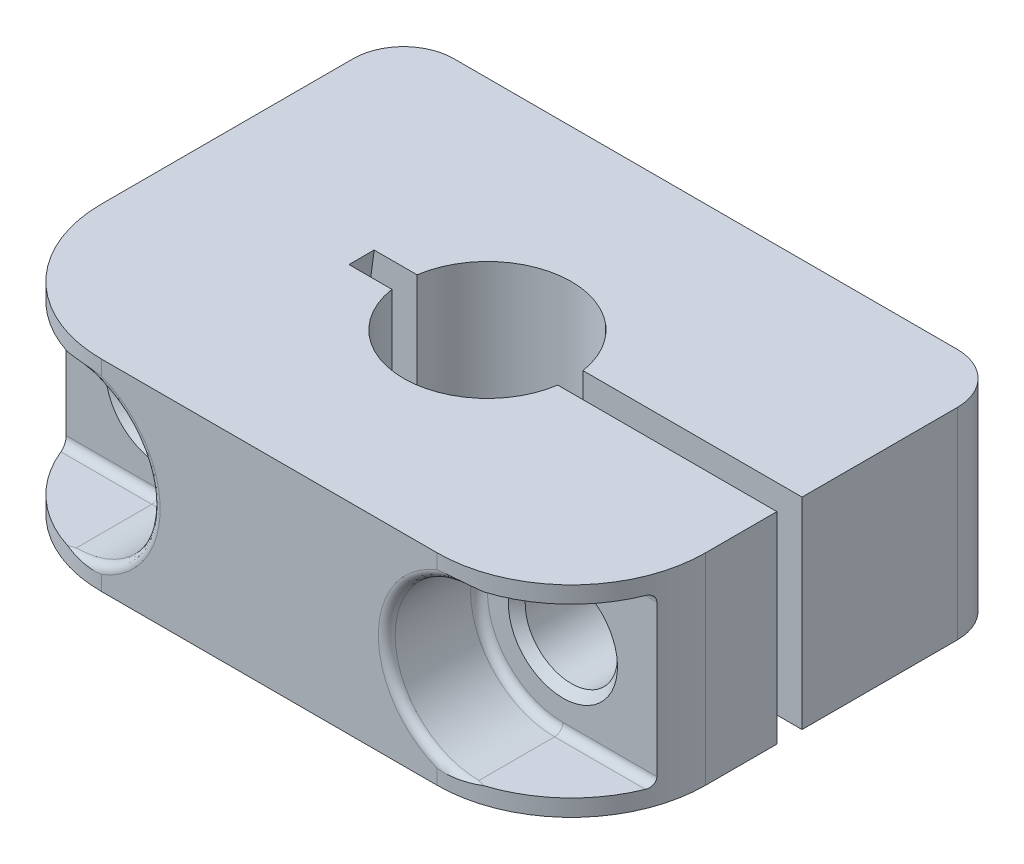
ISO-10303-21;
HEADER;
FILE_DESCRIPTION(('STEP AP214'),'2;1');
FILE_NAME('part.step','',(''),(''),'','','');
FILE_SCHEMA(('AUTOMOTIVE_DESIGN { 1 0 10303 214 1 1 1 1 }'));
ENDSEC;
DATA;
#1=APPLICATION_CONTEXT('core data for automotive mechanical design processes');
#2=APPLICATION_PROTOCOL_DEFINITION('international standard','automotive_design',2000,#1);
#3=PRODUCT_CONTEXT('',#1,'mechanical');
#4=PRODUCT('Part','Part','',(#3));
#5=PRODUCT_RELATED_PRODUCT_CATEGORY('part','',(#4));
#6=PRODUCT_DEFINITION_FORMATION('','',#4);
#7=PRODUCT_DEFINITION_CONTEXT('part definition',#1,'design');
#8=PRODUCT_DEFINITION('design','',#6,#7);
#9=PRODUCT_DEFINITION_SHAPE('','',#8);
#10=(LENGTH_UNIT() NAMED_UNIT(*) SI_UNIT(.MILLI.,.METRE.));
#11=(NAMED_UNIT(*) PLANE_ANGLE_UNIT() SI_UNIT($,.RADIAN.));
#12=(NAMED_UNIT(*) SI_UNIT($,.STERADIAN.) SOLID_ANGLE_UNIT());
#13=UNCERTAINTY_MEASURE_WITH_UNIT(LENGTH_MEASURE(1.E-05),#10,'distance_accuracy_value','');
#14=(GEOMETRIC_REPRESENTATION_CONTEXT(3) GLOBAL_UNCERTAINTY_ASSIGNED_CONTEXT((#13)) GLOBAL_UNIT_ASSIGNED_CONTEXT((#10,
#11,#12)) REPRESENTATION_CONTEXT('',''));
#15=CARTESIAN_POINT('',(0.,0.,0.));
#16=DIRECTION('',(0.,0.,1.));
#17=DIRECTION('',(1.,0.,0.));
#18=AXIS2_PLACEMENT_3D('',#15,#16,#17);
#19=CARTESIAN_POINT('',(24.,0.,21.));
#20=DIRECTION('',(0.,0.,-1.));
#21=DIRECTION('',(0.,1.,0.));
#22=AXIS2_PLACEMENT_3D('',#19,#20,#21);
#23=TOROIDAL_SURFACE('',#22,4.5,0.500000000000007);
#24=CARTESIAN_POINT('',(24.,0.,20.5));
#25=DIRECTION('',(0.,0.,-1.));
#26=DIRECTION('',(0.,-1.,0.));
#27=AXIS2_PLACEMENT_3D('',#24,#25,#26);
#28=CIRCLE('',#27,4.5);
#29=CARTESIAN_POINT('',(24.,4.5,20.5));
#30=VERTEX_POINT('',#29);
#31=CARTESIAN_POINT('',(24.,-4.5,20.5));
#32=VERTEX_POINT('',#31);
#33=EDGE_CURVE('E230',#30,#32,#28,.F.);
#34=ORIENTED_EDGE('',*,*,#33,.F.);
#35=CARTESIAN_POINT('',(24.,4.5,21.));
#36=DIRECTION('',(1.,0.,0.));
#37=DIRECTION('',(0.,1.,0.));
#38=AXIS2_PLACEMENT_3D('',#35,#36,#37);
#39=CIRCLE('',#38,0.5);
#40=CARTESIAN_POINT('',(24.,5.,21.));
#41=VERTEX_POINT('',#40);
#42=EDGE_CURVE('E221',#30,#41,#39,.T.);
#43=ORIENTED_EDGE('',*,*,#42,.T.);
#44=CARTESIAN_POINT('',(24.,0.,21.));
#45=DIRECTION('',(0.,0.,1.));
#46=DIRECTION('',(0.,-1.,0.));
#47=AXIS2_PLACEMENT_3D('',#44,#45,#46);
#48=CIRCLE('',#47,5.);
#49=CARTESIAN_POINT('',(24.,-5.,21.));
#50=VERTEX_POINT('',#49);
#51=EDGE_CURVE('E428',#41,#50,#48,.T.);
#52=ORIENTED_EDGE('',*,*,#51,.T.);
#53=CARTESIAN_POINT('',(24.,-4.5,21.));
#54=DIRECTION('',(1.,0.,0.));
#55=DIRECTION('',(0.,1.,0.));
#56=AXIS2_PLACEMENT_3D('',#53,#54,#55);
#57=CIRCLE('',#56,0.5);
#58=EDGE_CURVE('E222',#50,#32,#57,.T.);
#59=ORIENTED_EDGE('',*,*,#58,.T.);
#60=EDGE_LOOP('',(#34,#43,#52,#59));
#61=FACE_BOUND('',#60,.T.);
#62=ADVANCED_FACE('F14',(#61),#23,.F.);
#63=CARTESIAN_POINT('',(36.,-4.5,21.));
#64=DIRECTION('',(1.,0.,0.));
#65=DIRECTION('',(0.,1.,0.));
#66=AXIS2_PLACEMENT_3D('',#63,#64,#65);
#67=CYLINDRICAL_SURFACE('',#66,0.5);
#68=DIRECTION('',(1.,0.,0.));
#69=VECTOR('',#68,1.);
#70=CARTESIAN_POINT('',(28.5,-4.5,20.5));
#71=LINE('',#70,#69);
#72=CARTESIAN_POINT('',(29.5993420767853,-4.5,20.5));
#73=VERTEX_POINT('',#72);
#74=EDGE_CURVE('E215',#32,#73,#71,.T.);
#75=ORIENTED_EDGE('',*,*,#74,.F.);
#76=ORIENTED_EDGE('',*,*,#58,.F.);
#77=DIRECTION('',(-1.,0.,0.));
#78=VECTOR('',#77,1.);
#79=CARTESIAN_POINT('',(36.,-5.,21.));
#80=LINE('',#79,#78);
#81=CARTESIAN_POINT('',(29.4161984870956,-5.,21.));
#82=VERTEX_POINT('',#81);
#83=EDGE_CURVE('E217',#82,#50,#80,.T.);
#84=ORIENTED_EDGE('',*,*,#83,.F.);
#85=CARTESIAN_POINT('',(29.5993420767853,-4.5,20.5));
#86=CARTESIAN_POINT('',(29.5993472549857,-4.52705093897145,20.4999717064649));
#87=CARTESIAN_POINT('',(29.5986204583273,-4.55408810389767,20.5021933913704));
#88=CARTESIAN_POINT('',(29.595743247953,-4.60733048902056,20.5109205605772));
#89=CARTESIAN_POINT('',(29.5935956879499,-4.63353726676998,20.5174174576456));
#90=CARTESIAN_POINT('',(29.587916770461,-4.6844308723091,20.5344811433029));
#91=CARTESIAN_POINT('',(29.5843853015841,-4.70911757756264,20.5450482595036));
#92=CARTESIAN_POINT('',(29.576010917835,-4.75631760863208,20.5698697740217));
#93=CARTESIAN_POINT('',(29.5711677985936,-4.77883059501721,20.584124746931));
#94=CARTESIAN_POINT('',(29.5601670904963,-4.82151617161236,20.616135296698));
#95=CARTESIAN_POINT('',(29.5539871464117,-4.84163860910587,20.6339499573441));
#96=CARTESIAN_POINT('',(29.540494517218,-4.8786076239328,20.6723315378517));
#97=CARTESIAN_POINT('',(29.5331816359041,-4.89545363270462,20.6928989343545));
#98=CARTESIAN_POINT('',(29.5171995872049,-4.92626394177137,20.7372047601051));
#99=CARTESIAN_POINT('',(29.5084824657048,-4.94005314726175,20.761047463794));
#100=CARTESIAN_POINT('',(29.4901540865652,-4.96345838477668,20.8103887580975));
#101=CARTESIAN_POINT('',(29.4805424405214,-4.97307259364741,20.8358880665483));
#102=CARTESIAN_POINT('',(29.4619351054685,-4.98703519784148,20.8844596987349));
#103=CARTESIAN_POINT('',(29.4530220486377,-4.9919060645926,20.9074159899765));
#104=CARTESIAN_POINT('',(29.4348426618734,-4.9983882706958,20.9535979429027));
#105=CARTESIAN_POINT('',(29.4255770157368,-5.00000562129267,20.9768230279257));
#106=CARTESIAN_POINT('',(29.4161984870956,-5.,21.));
#107=B_SPLINE_CURVE_WITH_KNOTS('',3,(#85,#86,#87,#88,#89,#90,#91,#92,#93,#94,#95,#96,#97,#98,
#99,#100,#101,#102,#103,#104,#105,#106),.UNSPECIFIED.,.F.,.F.,(4,2,2,2,2,2,2,2,2,2,4),(0.,
0.0810309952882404,0.161899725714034,0.242774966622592,0.323662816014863,0.406025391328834,
0.488402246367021,0.574695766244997,0.661026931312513,0.736122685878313,0.811079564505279),.UNSPECIFIED.);
#108=EDGE_CURVE('E19',#73,#82,#107,.T.);
#109=ORIENTED_EDGE('',*,*,#108,.F.);
#110=EDGE_LOOP('',(#75,#76,#84,#109));
#111=FACE_BOUND('',#110,.T.);
#112=ADVANCED_FACE('F214',(#111),#67,.F.);
#113=CARTESIAN_POINT('',(36.,4.5,21.));
#114=DIRECTION('',(1.,0.,0.));
#115=DIRECTION('',(0.,1.,0.));
#116=AXIS2_PLACEMENT_3D('',#113,#114,#115);
#117=CYLINDRICAL_SURFACE('',#116,0.5);
#118=DIRECTION('',(1.,0.,0.));
#119=VECTOR('',#118,1.);
#120=CARTESIAN_POINT('',(36.,5.,21.));
#121=LINE('',#120,#119);
#122=CARTESIAN_POINT('',(29.4161984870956,5.,21.));
#123=VERTEX_POINT('',#122);
#124=EDGE_CURVE('E551',#41,#123,#121,.T.);
#125=ORIENTED_EDGE('',*,*,#124,.F.);
#126=ORIENTED_EDGE('',*,*,#42,.F.);
#127=DIRECTION('',(1.,0.,0.));
#128=VECTOR('',#127,1.);
#129=CARTESIAN_POINT('',(28.5,4.5,20.5));
#130=LINE('',#129,#128);
#131=CARTESIAN_POINT('',(29.5993420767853,4.5,20.5));
#132=VERTEX_POINT('',#131);
#133=EDGE_CURVE('E233',#132,#30,#130,.F.);
#134=ORIENTED_EDGE('',*,*,#133,.F.);
#135=CARTESIAN_POINT('',(29.4161984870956,5.,21.));
#136=CARTESIAN_POINT('',(29.428045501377,5.00001889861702,20.9707330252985));
#137=CARTESIAN_POINT('',(29.4397122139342,4.99743034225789,20.9413745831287));
#138=CARTESIAN_POINT('',(29.4624186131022,4.98707503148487,20.8832710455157));
#139=CARTESIAN_POINT('',(29.4734570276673,4.97929815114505,20.8545272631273));
#140=CARTESIAN_POINT('',(29.4946105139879,4.95858481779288,20.7985209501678));
#141=CARTESIAN_POINT('',(29.504723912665,4.9456392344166,20.7712611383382));
#142=CARTESIAN_POINT('',(29.5237304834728,4.91482971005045,20.719235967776));
#143=CARTESIAN_POINT('',(29.5326249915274,4.89697121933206,20.6944678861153));
#144=CARTESIAN_POINT('',(29.5485796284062,4.85770420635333,20.6494322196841));
#145=CARTESIAN_POINT('',(29.5557066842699,4.83650387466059,20.6290070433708));
#146=CARTESIAN_POINT('',(29.5684743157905,4.79055670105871,20.5920224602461));
#147=CARTESIAN_POINT('',(29.5741147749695,4.76580958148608,20.5754633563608));
#148=CARTESIAN_POINT('',(29.5834735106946,4.71510936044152,20.5477698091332));
#149=CARTESIAN_POINT('',(29.5872873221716,4.68931942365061,20.5363680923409));
#150=CARTESIAN_POINT('',(29.5933890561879,4.63604246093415,20.5180423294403));
#151=CARTESIAN_POINT('',(29.595679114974,4.60855787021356,20.5111120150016));
#152=CARTESIAN_POINT('',(29.5979030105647,4.56734483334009,20.5043710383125));
#153=CARTESIAN_POINT('',(29.59844279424,4.5539233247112,20.5027323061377));
#154=CARTESIAN_POINT('',(29.59916194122,4.52700352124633,20.5005476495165));
#155=CARTESIAN_POINT('',(29.5993418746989,4.51350538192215,20.4999999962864));
#156=CARTESIAN_POINT('',(29.5993420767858,4.5,20.5));
#157=B_SPLINE_CURVE_WITH_KNOTS('',3,(#135,#136,#137,#138,#139,#140,#141,#142,#143,#144,#145,
#146,#147,#148,#149,#150,#151,#152,#153,#154,#155,#156),.UNSPECIFIED.,.F.,.F.,(4,2,2,2,2,2,2,2,
2,2,4),(0.,0.0946423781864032,0.189470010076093,0.28446589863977,0.379356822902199,
0.469753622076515,0.560157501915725,0.64510008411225,0.729923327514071,0.770477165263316,
0.810966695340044),.UNSPECIFIED.);
#158=EDGE_CURVE('E237',#123,#132,#157,.T.);
#159=ORIENTED_EDGE('',*,*,#158,.F.);
#160=EDGE_LOOP('',(#125,#126,#134,#159));
#161=FACE_BOUND('',#160,.T.);
#162=ADVANCED_FACE('F659',(#161),#117,.F.);
#163=CARTESIAN_POINT('',(24.,0.,0.));
#164=DIRECTION('',(0.,0.,1.));
#165=DIRECTION('',(0.,-1.,0.));
#166=AXIS2_PLACEMENT_3D('',#163,#164,#165);
#167=CYLINDRICAL_SURFACE('',#166,5.);
#168=DIRECTION('',(0.,0.,1.));
#169=VECTOR('',#168,1.);
#170=CARTESIAN_POINT('',(24.,-5.,26.));
#171=LINE('',#170,#169);
#172=CARTESIAN_POINT('',(24.,-5.,25.5));
#173=VERTEX_POINT('',#172);
#174=EDGE_CURVE('E394',#50,#173,#171,.T.);
#175=ORIENTED_EDGE('',*,*,#174,.F.);
#176=ORIENTED_EDGE('',*,*,#51,.F.);
#177=DIRECTION('',(0.,0.,1.));
#178=VECTOR('',#177,1.);
#179=CARTESIAN_POINT('',(24.,5.,21.));
#180=LINE('',#179,#178);
#181=CARTESIAN_POINT('',(24.,5.,25.5));
#182=VERTEX_POINT('',#181);
#183=EDGE_CURVE('E401',#182,#41,#180,.F.);
#184=ORIENTED_EDGE('',*,*,#183,.F.);
#185=CARTESIAN_POINT('',(24.,0.,25.5));
#186=DIRECTION('',(0.,0.,-1.));
#187=DIRECTION('',(0.,1.,0.));
#188=AXIS2_PLACEMENT_3D('',#185,#186,#187);
#189=CIRCLE('',#188,5.);
#190=EDGE_CURVE('E757',#173,#182,#189,.T.);
#191=ORIENTED_EDGE('',*,*,#190,.F.);
#192=EDGE_LOOP('',(#175,#176,#184,#191));
#193=FACE_BOUND('',#192,.T.);
#194=ADVANCED_FACE('F663',(#193),#167,.F.);
#195=CARTESIAN_POINT('',(0.,0.,20.49999999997));
#196=DIRECTION('',(0.,0.,1.));
#197=DIRECTION('',(0.,-1.,0.));
#198=AXIS2_PLACEMENT_3D('',#195,#196,#197);
#199=CONICAL_SURFACE('',#198,3.2499999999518,0.785398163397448);
#200=CARTESIAN_POINT('',(0.,0.,20.49999999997));
#201=DIRECTION('',(0.,0.,1.));
#202=DIRECTION('',(0.,-1.,0.));
#203=AXIS2_PLACEMENT_3D('',#200,#201,#202);
#204=CIRCLE('',#203,3.2499999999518);
#205=CARTESIAN_POINT('',(0.,-3.2499999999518,20.49999999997));
#206=VERTEX_POINT('',#205);
#207=EDGE_CURVE('E543',#206,#206,#204,.F.);
#208=ORIENTED_EDGE('',*,*,#207,.F.);
#209=EDGE_LOOP('',(#208));
#210=FACE_BOUND('',#209,.T.);
#211=CARTESIAN_POINT('',(0.,0.,20.));
#212=DIRECTION('',(0.,0.,1.));
#213=DIRECTION('',(0.,-1.,0.));
#214=AXIS2_PLACEMENT_3D('',#211,#212,#213);
#215=CIRCLE('',#214,2.75);
#216=CARTESIAN_POINT('',(0.,-2.75,20.));
#217=VERTEX_POINT('',#216);
#218=EDGE_CURVE('E816',#217,#217,#215,.F.);
#219=ORIENTED_EDGE('',*,*,#218,.T.);
#220=EDGE_LOOP('',(#219));
#221=FACE_BOUND('',#220,.T.);
#222=ADVANCED_FACE('F830',(#210,#221),#199,.F.);
#223=CARTESIAN_POINT('',(0.,0.,21.));
#224=DIRECTION('',(0.,0.,-1.));
#225=DIRECTION('',(0.,1.,0.));
#226=AXIS2_PLACEMENT_3D('',#223,#224,#225);
#227=TOROIDAL_SURFACE('',#226,4.5,0.5);
#228=CARTESIAN_POINT('',(0.,4.5,21.));
#229=DIRECTION('',(-1.,0.,0.));
#230=DIRECTION('',(0.,-1.,0.));
#231=AXIS2_PLACEMENT_3D('',#228,#229,#230);
#232=CIRCLE('',#231,0.5);
#233=CARTESIAN_POINT('',(0.,5.,21.));
#234=VERTEX_POINT('',#233);
#235=CARTESIAN_POINT('',(0.,4.5,20.5));
#236=VERTEX_POINT('',#235);
#237=EDGE_CURVE('E559',#234,#236,#232,.T.);
#238=ORIENTED_EDGE('',*,*,#237,.T.);
#239=CARTESIAN_POINT('',(0.,0.,20.5));
#240=DIRECTION('',(0.,0.,-1.));
#241=DIRECTION('',(0.,1.,0.));
#242=AXIS2_PLACEMENT_3D('',#239,#240,#241);
#243=CIRCLE('',#242,4.5);
#244=CARTESIAN_POINT('',(0.,-4.5,20.5));
#245=VERTEX_POINT('',#244);
#246=EDGE_CURVE('E546',#245,#236,#243,.F.);
#247=ORIENTED_EDGE('',*,*,#246,.F.);
#248=CARTESIAN_POINT('',(0.,-4.5,21.));
#249=DIRECTION('',(-1.,0.,0.));
#250=DIRECTION('',(0.,-1.,0.));
#251=AXIS2_PLACEMENT_3D('',#248,#249,#250);
#252=CIRCLE('',#251,0.5);
#253=CARTESIAN_POINT('',(0.,-5.,21.));
#254=VERTEX_POINT('',#253);
#255=EDGE_CURVE('E560',#245,#254,#252,.T.);
#256=ORIENTED_EDGE('',*,*,#255,.T.);
#257=CARTESIAN_POINT('',(0.,0.,21.));
#258=DIRECTION('',(0.,0.,1.));
#259=DIRECTION('',(0.,-1.,0.));
#260=AXIS2_PLACEMENT_3D('',#257,#258,#259);
#261=CIRCLE('',#260,5.);
#262=EDGE_CURVE('E811',#254,#234,#261,.T.);
#263=ORIENTED_EDGE('',*,*,#262,.T.);
#264=EDGE_LOOP('',(#238,#247,#256,#263));
#265=FACE_BOUND('',#264,.T.);
#266=ADVANCED_FACE('F826',(#265),#227,.F.);
#267=CARTESIAN_POINT('',(-12.,-4.5,21.));
#268=DIRECTION('',(-1.,0.,0.));
#269=DIRECTION('',(0.,-1.,0.));
#270=AXIS2_PLACEMENT_3D('',#267,#268,#269);
#271=CYLINDRICAL_SURFACE('',#270,0.5);
#272=ORIENTED_EDGE('',*,*,#255,.F.);
#273=DIRECTION('',(1.,0.,0.));
#274=VECTOR('',#273,1.);
#275=CARTESIAN_POINT('',(4.5,-4.5,20.5));
#276=LINE('',#275,#274);
#277=CARTESIAN_POINT('',(-5.59934207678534,-4.5,20.5));
#278=VERTEX_POINT('',#277);
#279=EDGE_CURVE('E889',#278,#245,#276,.T.);
#280=ORIENTED_EDGE('',*,*,#279,.F.);
#281=CARTESIAN_POINT('',(-5.41619848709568,-5.,21.));
#282=CARTESIAN_POINT('',(-5.42804550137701,-5.00001889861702,20.9707330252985));
#283=CARTESIAN_POINT('',(-5.43971221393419,-4.99743034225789,20.9413745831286));
#284=CARTESIAN_POINT('',(-5.4624186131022,-4.98707503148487,20.8832710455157));
#285=CARTESIAN_POINT('',(-5.47345702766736,-4.97929815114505,20.8545272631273));
#286=CARTESIAN_POINT('',(-5.4946105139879,-4.95858481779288,20.7985209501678));
#287=CARTESIAN_POINT('',(-5.50472391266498,-4.94563923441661,20.7712611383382));
#288=CARTESIAN_POINT('',(-5.52373048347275,-4.91482971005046,20.719235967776));
#289=CARTESIAN_POINT('',(-5.53262499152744,-4.89697121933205,20.6944678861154));
#290=CARTESIAN_POINT('',(-5.54857962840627,-4.85770420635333,20.6494322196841));
#291=CARTESIAN_POINT('',(-5.55570668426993,-4.8365038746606,20.6290070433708));
#292=CARTESIAN_POINT('',(-5.56847431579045,-4.79055670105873,20.5920224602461));
#293=CARTESIAN_POINT('',(-5.57411477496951,-4.76580958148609,20.5754633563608));
#294=CARTESIAN_POINT('',(-5.58347351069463,-4.71510936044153,20.5477698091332));
#295=CARTESIAN_POINT('',(-5.58728732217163,-4.68931942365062,20.5363680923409));
#296=CARTESIAN_POINT('',(-5.59338905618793,-4.63604246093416,20.5180423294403));
#297=CARTESIAN_POINT('',(-5.59567911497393,-4.60855787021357,20.5111120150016));
#298=CARTESIAN_POINT('',(-5.59790301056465,-4.5673448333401,20.5043710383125));
#299=CARTESIAN_POINT('',(-5.59844279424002,-4.5539233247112,20.5027323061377));
#300=CARTESIAN_POINT('',(-5.59916194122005,-4.52700352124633,20.5005476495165));
#301=CARTESIAN_POINT('',(-5.59934187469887,-4.51350538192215,20.4999999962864));
#302=CARTESIAN_POINT('',(-5.59934207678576,-4.5,20.5));
#303=B_SPLINE_CURVE_WITH_KNOTS('',3,(#281,#282,#283,#284,#285,#286,#287,#288,#289,#290,#291,
#292,#293,#294,#295,#296,#297,#298,#299,#300,#301,#302),.UNSPECIFIED.,.F.,.F.,(4,2,2,2,2,2,2,2,
2,2,4),(0.,0.0946423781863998,0.189470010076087,0.284465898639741,0.379356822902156,
0.469753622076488,0.560157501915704,0.645100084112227,0.729923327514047,0.770477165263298,
0.810966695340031),.UNSPECIFIED.);
#304=CARTESIAN_POINT('',(-5.41619848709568,-5.,21.));
#305=VERTEX_POINT('',#304);
#306=EDGE_CURVE('E436',#305,#278,#303,.T.);
#307=ORIENTED_EDGE('',*,*,#306,.F.);
#308=DIRECTION('',(1.,0.,0.));
#309=VECTOR('',#308,1.);
#310=CARTESIAN_POINT('',(-12.,-5.,21.));
#311=LINE('',#310,#309);
#312=EDGE_CURVE('E753',#305,#254,#311,.T.);
#313=ORIENTED_EDGE('',*,*,#312,.T.);
#314=EDGE_LOOP('',(#272,#280,#307,#313));
#315=FACE_BOUND('',#314,.T.);
#316=ADVANCED_FACE('F829',(#315),#271,.F.);
#317=CARTESIAN_POINT('',(-12.,4.5,21.));
#318=DIRECTION('',(-1.,0.,0.));
#319=DIRECTION('',(0.,-1.,0.));
#320=AXIS2_PLACEMENT_3D('',#317,#318,#319);
#321=CYLINDRICAL_SURFACE('',#320,0.5);
#322=ORIENTED_EDGE('',*,*,#237,.F.);
#323=DIRECTION('',(-1.,0.,0.));
#324=VECTOR('',#323,1.);
#325=CARTESIAN_POINT('',(-12.,5.,21.));
#326=LINE('',#325,#324);
#327=CARTESIAN_POINT('',(-5.41619848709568,5.,21.));
#328=VERTEX_POINT('',#327);
#329=EDGE_CURVE('E888',#234,#328,#326,.T.);
#330=ORIENTED_EDGE('',*,*,#329,.T.);
#331=CARTESIAN_POINT('',(-5.59934207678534,4.5,20.5));
#332=CARTESIAN_POINT('',(-5.59934725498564,4.52705093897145,20.4999717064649));
#333=CARTESIAN_POINT('',(-5.59862045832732,4.55408810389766,20.5021933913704));
#334=CARTESIAN_POINT('',(-5.59574324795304,4.60733048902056,20.5109205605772));
#335=CARTESIAN_POINT('',(-5.59359568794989,4.63353726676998,20.5174174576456));
#336=CARTESIAN_POINT('',(-5.58791677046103,4.6844308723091,20.5344811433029));
#337=CARTESIAN_POINT('',(-5.58438530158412,4.70911757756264,20.5450482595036));
#338=CARTESIAN_POINT('',(-5.57601091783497,4.75631760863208,20.5698697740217));
#339=CARTESIAN_POINT('',(-5.57116779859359,4.77883059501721,20.584124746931));
#340=CARTESIAN_POINT('',(-5.5601670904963,4.82151617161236,20.616135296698));
#341=CARTESIAN_POINT('',(-5.55398714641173,4.84163860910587,20.6339499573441));
#342=CARTESIAN_POINT('',(-5.54049451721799,4.8786076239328,20.6723315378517));
#343=CARTESIAN_POINT('',(-5.53318163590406,4.89545363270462,20.6928989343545));
#344=CARTESIAN_POINT('',(-5.51719958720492,4.92626394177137,20.7372047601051));
#345=CARTESIAN_POINT('',(-5.50848246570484,4.94005314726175,20.761047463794));
#346=CARTESIAN_POINT('',(-5.49015408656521,4.96345838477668,20.8103887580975));
#347=CARTESIAN_POINT('',(-5.48054244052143,4.9730725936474,20.8358880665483));
#348=CARTESIAN_POINT('',(-5.46193510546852,4.98703519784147,20.8844596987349));
#349=CARTESIAN_POINT('',(-5.45302204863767,4.9919060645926,20.9074159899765));
#350=CARTESIAN_POINT('',(-5.43484266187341,4.9983882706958,20.9535979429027));
#351=CARTESIAN_POINT('',(-5.4255770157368,5.00000562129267,20.9768230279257));
#352=CARTESIAN_POINT('',(-5.41619848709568,5.,21.));
#353=B_SPLINE_CURVE_WITH_KNOTS('',3,(#331,#332,#333,#334,#335,#336,#337,#338,#339,#340,#341,
#342,#343,#344,#345,#346,#347,#348,#349,#350,#351,#352),.UNSPECIFIED.,.F.,.F.,(4,2,2,2,2,2,2,2,
2,2,4),(0.,0.0810309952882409,0.161899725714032,0.242774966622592,0.323662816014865,
0.406025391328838,0.488402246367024,0.574695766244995,0.661026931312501,0.736122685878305,
0.811079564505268),.UNSPECIFIED.);
#354=CARTESIAN_POINT('',(-5.59934207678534,4.5,20.5));
#355=VERTEX_POINT('',#354);
#356=EDGE_CURVE('E552',#355,#328,#353,.T.);
#357=ORIENTED_EDGE('',*,*,#356,.F.);
#358=DIRECTION('',(1.,0.,0.));
#359=VECTOR('',#358,1.);
#360=CARTESIAN_POINT('',(4.5,4.5,20.5));
#361=LINE('',#360,#359);
#362=EDGE_CURVE('E918',#236,#355,#361,.F.);
#363=ORIENTED_EDGE('',*,*,#362,.F.);
#364=EDGE_LOOP('',(#322,#330,#357,#363));
#365=FACE_BOUND('',#364,.T.);
#366=ADVANCED_FACE('F566',(#365),#321,.F.);
#367=CARTESIAN_POINT('',(0.,0.,0.));
#368=DIRECTION('',(0.,0.,1.));
#369=DIRECTION('',(0.,-1.,0.));
#370=AXIS2_PLACEMENT_3D('',#367,#368,#369);
#371=CYLINDRICAL_SURFACE('',#370,5.);
#372=ORIENTED_EDGE('',*,*,#262,.F.);
#373=DIRECTION('',(0.,0.,1.));
#374=VECTOR('',#373,1.);
#375=CARTESIAN_POINT('',(0.,-5.,26.));
#376=LINE('',#375,#374);
#377=CARTESIAN_POINT('',(0.,-5.,25.5));
#378=VERTEX_POINT('',#377);
#379=EDGE_CURVE('E547',#254,#378,#376,.T.);
#380=ORIENTED_EDGE('',*,*,#379,.T.);
#381=CARTESIAN_POINT('',(0.,0.,25.5));
#382=DIRECTION('',(0.,0.,-1.));
#383=DIRECTION('',(0.,1.,0.));
#384=AXIS2_PLACEMENT_3D('',#381,#382,#383);
#385=CIRCLE('',#384,5.);
#386=CARTESIAN_POINT('',(0.,5.,25.5));
#387=VERTEX_POINT('',#386);
#388=EDGE_CURVE('E292',#387,#378,#385,.T.);
#389=ORIENTED_EDGE('',*,*,#388,.F.);
#390=DIRECTION('',(0.,0.,1.));
#391=VECTOR('',#390,1.);
#392=CARTESIAN_POINT('',(0.,5.,21.));
#393=LINE('',#392,#391);
#394=EDGE_CURVE('E885',#387,#234,#393,.F.);
#395=ORIENTED_EDGE('',*,*,#394,.T.);
#396=EDGE_LOOP('',(#372,#380,#389,#395));
#397=FACE_BOUND('',#396,.T.);
#398=ADVANCED_FACE('F925',(#397),#371,.F.);
#399=CARTESIAN_POINT('',(0.,0.,0.));
#400=DIRECTION('',(0.,0.,1.));
#401=DIRECTION('',(0.,-1.,0.));
#402=AXIS2_PLACEMENT_3D('',#399,#400,#401);
#403=CYLINDRICAL_SURFACE('',#402,2.75);
#404=ORIENTED_EDGE('',*,*,#218,.F.);
#405=EDGE_LOOP('',(#404));
#406=FACE_BOUND('',#405,.T.);
#407=CARTESIAN_POINT('',(0.,0.,0.50000000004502));
#408=DIRECTION('',(0.,0.,-1.));
#409=DIRECTION('',(0.,1.,0.));
#410=AXIS2_PLACEMENT_3D('',#407,#408,#409);
#411=CIRCLE('',#410,2.75000000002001);
#412=CARTESIAN_POINT('',(0.,2.75000000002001,0.50000000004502));
#413=VERTEX_POINT('',#412);
#414=EDGE_CURVE('E282',#413,#413,#411,.T.);
#415=ORIENTED_EDGE('',*,*,#414,.T.);
#416=EDGE_LOOP('',(#415));
#417=FACE_BOUND('',#416,.T.);
#418=ADVANCED_FACE('F930',(#406,#417),#403,.F.);
#419=CARTESIAN_POINT('',(24.,0.,20.49999999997));
#420=DIRECTION('',(0.,0.,1.));
#421=DIRECTION('',(0.,-1.,0.));
#422=AXIS2_PLACEMENT_3D('',#419,#420,#421);
#423=CONICAL_SURFACE('',#422,3.2499999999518,0.785398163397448);
#424=CARTESIAN_POINT('',(24.,0.,20.49999999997));
#425=DIRECTION('',(0.,0.,1.));
#426=DIRECTION('',(0.,-1.,0.));
#427=AXIS2_PLACEMENT_3D('',#424,#425,#426);
#428=CIRCLE('',#427,3.2499999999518);
#429=CARTESIAN_POINT('',(24.,-3.2499999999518,20.49999999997));
#430=VERTEX_POINT('',#429);
#431=EDGE_CURVE('E548',#430,#430,#428,.F.);
#432=ORIENTED_EDGE('',*,*,#431,.F.);
#433=EDGE_LOOP('',(#432));
#434=FACE_BOUND('',#433,.T.);
#435=CARTESIAN_POINT('',(24.,0.,20.));
#436=DIRECTION('',(0.,0.,1.));
#437=DIRECTION('',(0.,-1.,0.));
#438=AXIS2_PLACEMENT_3D('',#435,#436,#437);
#439=CIRCLE('',#438,2.75);
#440=CARTESIAN_POINT('',(24.,-2.75,20.));
#441=VERTEX_POINT('',#440);
#442=EDGE_CURVE('E260',#441,#441,#439,.F.);
#443=ORIENTED_EDGE('',*,*,#442,.T.);
#444=EDGE_LOOP('',(#443));
#445=FACE_BOUND('',#444,.T.);
#446=ADVANCED_FACE('F998',(#434,#445),#423,.F.);
#447=CARTESIAN_POINT('',(36.,-5.,26.));
#448=DIRECTION('',(0.,1.,0.));
#449=DIRECTION('',(-1.,0.,0.));
#450=AXIS2_PLACEMENT_3D('',#447,#448,#449);
#451=PLANE('',#450);
#452=ORIENTED_EDGE('',*,*,#174,.T.);
#453=CARTESIAN_POINT('',(24.409853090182,-5.,25.6284079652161));
#454=CARTESIAN_POINT('',(24.3927066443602,-5.00001168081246,25.6231803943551));
#455=CARTESIAN_POINT('',(24.3755676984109,-5.00001980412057,25.617928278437));
#456=CARTESIAN_POINT('',(24.341314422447,-5.00003075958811,25.6073844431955));
#457=CARTESIAN_POINT('',(24.3242000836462,-5.00003359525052,25.6020927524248));
#458=CARTESIAN_POINT('',(24.2899926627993,-5.00003580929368,25.591475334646));
#459=CARTESIAN_POINT('',(24.2728995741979,-5.00003518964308,25.5861496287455));
#460=CARTESIAN_POINT('',(24.2387312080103,-5.00003198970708,25.5754698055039));
#461=CARTESIAN_POINT('',(24.2216559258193,-5.00002941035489,25.5701157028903));
#462=CARTESIAN_POINT('',(24.1875196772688,-5.00002353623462,25.5593847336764));
#463=CARTESIAN_POINT('',(24.170458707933,-5.00002024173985,25.5540078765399));
#464=CARTESIAN_POINT('',(24.1363475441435,-5.00001389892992,25.5432370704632));
#465=CARTESIAN_POINT('',(24.1192973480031,-5.00001085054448,25.5378431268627));
#466=CARTESIAN_POINT('',(24.0852041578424,-5.00000570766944,25.5270438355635));
#467=CARTESIAN_POINT('',(24.0681611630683,-5.00000361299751,25.5216384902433));
#468=CARTESIAN_POINT('',(24.0340787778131,-5.00000073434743,25.5108220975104));
#469=CARTESIAN_POINT('',(24.017039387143,-4.99999995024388,25.505411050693));
#470=CARTESIAN_POINT('',(24.,-5.,25.5));
#471=B_SPLINE_CURVE_WITH_KNOTS('',3,(#453,#454,#455,#456,#457,#458,#459,#460,#461,#462,#463,
#464,#465,#466,#467,#468,#469,#470),.UNSPECIFIED.,.F.,.F.,(4,2,2,2,2,2,2,2,4),(0.,
0.0537768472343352,0.107518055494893,0.161228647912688,0.214913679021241,0.268578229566,
0.322227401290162,0.375866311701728,0.42950008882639),.UNSPECIFIED.);
#472=CARTESIAN_POINT('',(24.4098530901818,-5.,25.6284079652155));
#473=VERTEX_POINT('',#472);
#474=EDGE_CURVE('E389',#473,#173,#471,.T.);
#475=ORIENTED_EDGE('',*,*,#474,.F.);
#476=CARTESIAN_POINT('',(22.,-5.,18.));
#477=DIRECTION('',(0.,-1.,0.));
#478=DIRECTION('',(1.,0.,0.));
#479=AXIS2_PLACEMENT_3D('',#476,#477,#478);
#480=CIRCLE('',#479,8.);
#481=EDGE_CURVE('E535',#82,#473,#480,.T.);
#482=ORIENTED_EDGE('',*,*,#481,.F.);
#483=ORIENTED_EDGE('',*,*,#83,.T.);
#484=EDGE_LOOP('',(#452,#475,#482,#483));
#485=FACE_BOUND('',#484,.T.);
#486=ADVANCED_FACE('F368',(#485),#451,.T.);
#487=CARTESIAN_POINT('',(36.,5.,21.));
#488=DIRECTION('',(0.,-1.,0.));
#489=DIRECTION('',(1.,0.,0.));
#490=AXIS2_PLACEMENT_3D('',#487,#488,#489);
#491=PLANE('',#490);
#492=ORIENTED_EDGE('',*,*,#183,.T.);
#493=ORIENTED_EDGE('',*,*,#124,.T.);
#494=CARTESIAN_POINT('',(22.,5.,18.));
#495=DIRECTION('',(0.,-1.,0.));
#496=DIRECTION('',(1.,0.,0.));
#497=AXIS2_PLACEMENT_3D('',#494,#495,#496);
#498=CIRCLE('',#497,8.);
#499=CARTESIAN_POINT('',(24.4098530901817,5.,25.6284079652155));
#500=VERTEX_POINT('',#499);
#501=EDGE_CURVE('E240',#500,#123,#498,.F.);
#502=ORIENTED_EDGE('',*,*,#501,.F.);
#503=CARTESIAN_POINT('',(24.,5.,25.5));
#504=CARTESIAN_POINT('',(24.017039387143,4.99999995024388,25.505411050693));
#505=CARTESIAN_POINT('',(24.0340787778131,5.00000073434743,25.5108220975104));
#506=CARTESIAN_POINT('',(24.0681611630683,5.00000361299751,25.5216384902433));
#507=CARTESIAN_POINT('',(24.0852041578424,5.00000570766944,25.5270438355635));
#508=CARTESIAN_POINT('',(24.1192973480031,5.00001085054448,25.5378431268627));
#509=CARTESIAN_POINT('',(24.1363475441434,5.00001389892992,25.5432370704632));
#510=CARTESIAN_POINT('',(24.170458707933,5.00002024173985,25.5540078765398));
#511=CARTESIAN_POINT('',(24.1875196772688,5.00002353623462,25.5593847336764));
#512=CARTESIAN_POINT('',(24.2216559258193,5.00002941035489,25.5701157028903));
#513=CARTESIAN_POINT('',(24.2387312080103,5.00003198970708,25.5754698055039));
#514=CARTESIAN_POINT('',(24.2728995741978,5.00003518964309,25.5861496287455));
#515=CARTESIAN_POINT('',(24.2899926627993,5.00003580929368,25.591475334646));
#516=CARTESIAN_POINT('',(24.3242000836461,5.00003359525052,25.6020927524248));
#517=CARTESIAN_POINT('',(24.3413144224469,5.00003075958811,25.6073844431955));
#518=CARTESIAN_POINT('',(24.3755676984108,5.00001980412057,25.617928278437));
#519=CARTESIAN_POINT('',(24.3927066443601,5.00001168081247,25.6231803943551));
#520=CARTESIAN_POINT('',(24.4098530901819,5.00000000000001,25.6284079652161));
#521=B_SPLINE_CURVE_WITH_KNOTS('',3,(#503,#504,#505,#506,#507,#508,#509,#510,#511,#512,#513,
#514,#515,#516,#517,#518,#519,#520),.UNSPECIFIED.,.F.,.F.,(4,2,2,2,2,2,2,2,4),(0.,
0.0536337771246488,0.107272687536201,0.160921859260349,0.214586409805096,0.268271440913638,
0.321982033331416,0.375723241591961,0.429500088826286),.UNSPECIFIED.);
#522=EDGE_CURVE('E755',#182,#500,#521,.T.);
#523=ORIENTED_EDGE('',*,*,#522,.F.);
#524=EDGE_LOOP('',(#492,#493,#502,#523));
#525=FACE_BOUND('',#524,.T.);
#526=ADVANCED_FACE('F361',(#525),#491,.T.);
#527=CARTESIAN_POINT('',(28.5,0.,20.5));
#528=DIRECTION('',(0.,0.,1.));
#529=DIRECTION('',(0.,-1.,0.));
#530=AXIS2_PLACEMENT_3D('',#527,#528,#529);
#531=PLANE('',#530);
#532=DIRECTION('',(0.,-1.,0.));
#533=VECTOR('',#532,1.);
#534=CARTESIAN_POINT('',(29.5993420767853,-6.,20.5));
#535=LINE('',#534,#533);
#536=EDGE_CURVE('E228',#132,#73,#535,.T.);
#537=ORIENTED_EDGE('',*,*,#536,.F.);
#538=ORIENTED_EDGE('',*,*,#133,.T.);
#539=ORIENTED_EDGE('',*,*,#33,.T.);
#540=ORIENTED_EDGE('',*,*,#74,.T.);
#541=EDGE_LOOP('',(#537,#538,#539,#540));
#542=FACE_BOUND('',#541,.T.);
#543=ORIENTED_EDGE('',*,*,#431,.T.);
#544=EDGE_LOOP('',(#543));
#545=FACE_BOUND('',#544,.T.);
#546=ADVANCED_FACE('F225',(#542,#545),#531,.T.);
#547=CARTESIAN_POINT('',(24.,0.,25.5));
#548=DIRECTION('',(0.,0.,-1.));
#549=DIRECTION('',(0.,1.,0.));
#550=AXIS2_PLACEMENT_3D('',#547,#548,#549);
#551=TOROIDAL_SURFACE('',#550,5.5,0.5);
#552=CARTESIAN_POINT('',(24.4098530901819,5.00000000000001,25.6284079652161));
#553=CARTESIAN_POINT('',(24.3494206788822,5.01005644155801,25.6474902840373));
#554=CARTESIAN_POINT('',(24.2887379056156,5.02000782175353,25.6658494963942));
#555=CARTESIAN_POINT('',(24.1522471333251,5.04178578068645,25.7053682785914));
#556=CARTESIAN_POINT('',(24.0763071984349,5.05348862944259,25.7261412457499));
#557=CARTESIAN_POINT('',(23.9515295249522,5.07165729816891,25.7583166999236));
#558=CARTESIAN_POINT('',(23.9029108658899,5.07847618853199,25.7703731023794));
#559=CARTESIAN_POINT('',(23.7944749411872,5.09301585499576,25.7962063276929));
#560=CARTESIAN_POINT('',(23.7345864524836,5.10059696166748,25.8097643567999));
#561=CARTESIAN_POINT('',(23.6087761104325,5.11540790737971,25.8367356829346));
#562=CARTESIAN_POINT('',(23.542814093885,5.12253849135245,25.8500167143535));
#563=CARTESIAN_POINT('',(23.4046191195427,5.13594978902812,25.8760219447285));
#564=CARTESIAN_POINT('',(23.3323447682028,5.14210063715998,25.8885944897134));
#565=CARTESIAN_POINT('',(23.1769809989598,5.15317494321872,25.9133760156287));
#566=CARTESIAN_POINT('',(23.0938205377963,5.15779784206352,25.9252768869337));
#567=CARTESIAN_POINT('',(22.9149782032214,5.16471029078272,25.9480178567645));
#568=CARTESIAN_POINT('',(22.8192272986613,5.16656490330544,25.9584546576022));
#569=CARTESIAN_POINT('',(22.6377478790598,5.16626387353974,25.9749471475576));
#570=CARTESIAN_POINT('',(22.5520507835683,5.16451868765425,25.9813536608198));
#571=CARTESIAN_POINT('',(22.3972612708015,5.15815046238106,25.9904110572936));
#572=CARTESIAN_POINT('',(22.3281717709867,5.1541511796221,25.9935493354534));
#573=CARTESIAN_POINT('',(22.2071798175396,5.14498718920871,25.9974772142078));
#574=CARTESIAN_POINT('',(22.1552491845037,5.14035469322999,25.9986555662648));
#575=CARTESIAN_POINT('',(22.0688909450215,5.13148383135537,25.9997755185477));
#576=CARTESIAN_POINT('',(22.0344267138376,5.12763315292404,25.9999991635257));
#577=CARTESIAN_POINT('',(22.,5.1234753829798,26.));
#578=B_SPLINE_CURVE_WITH_KNOTS('',3,(#552,#553,#554,#555,#556,#557,#558,#559,#560,#561,#562,
#563,#564,#565,#566,#567,#568,#569,#570,#571,#572,#573,#574,#575,#576,#577),.UNSPECIFIED.,.F.,
.F.,(4,2,2,2,2,2,2,2,2,2,2,2,4),(0.,0.192503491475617,0.431246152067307,0.582895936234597,
0.768483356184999,0.971437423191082,1.19223772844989,1.44455800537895,1.7334238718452,
1.99117375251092,2.19893674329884,2.35535850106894,2.45938825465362),.UNSPECIFIED.);
#579=CARTESIAN_POINT('',(22.,5.1234753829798,26.));
#580=VERTEX_POINT('',#579);
#581=EDGE_CURVE('E245',#580,#500,#578,.F.);
#582=ORIENTED_EDGE('',*,*,#581,.F.);
#583=CARTESIAN_POINT('',(24.,0.,26.));
#584=DIRECTION('',(0.,0.,1.));
#585=DIRECTION('',(-0.363636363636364,0.9315409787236,0.));
#586=AXIS2_PLACEMENT_3D('',#583,#584,#585);
#587=CIRCLE('',#586,5.5);
#588=CARTESIAN_POINT('',(22.,-5.1234753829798,26.));
#589=VERTEX_POINT('',#588);
#590=EDGE_CURVE('E618',#580,#589,#587,.T.);
#591=ORIENTED_EDGE('',*,*,#590,.T.);
#592=CARTESIAN_POINT('',(22.,-5.1234753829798,26.));
#593=CARTESIAN_POINT('',(22.0689275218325,-5.1317641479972,26.0000032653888));
#594=CARTESIAN_POINT('',(22.1380064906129,-5.13874098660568,25.9990975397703));
#595=CARTESIAN_POINT('',(22.2759483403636,-5.15019601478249,25.9954755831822));
#596=CARTESIAN_POINT('',(22.344810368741,-5.15468751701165,25.9927691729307));
#597=CARTESIAN_POINT('',(22.482179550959,-5.16136539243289,25.9855726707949));
#598=CARTESIAN_POINT('',(22.5506866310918,-5.1635639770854,25.9810922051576));
#599=CARTESIAN_POINT('',(22.6872416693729,-5.16586709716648,25.9704049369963));
#600=CARTESIAN_POINT('',(22.7552901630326,-5.16598245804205,25.9642072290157));
#601=CARTESIAN_POINT('',(22.8908465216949,-5.16429796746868,25.9501374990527));
#602=CARTESIAN_POINT('',(22.9583553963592,-5.1625075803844,25.9422739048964));
#603=CARTESIAN_POINT('',(23.0928008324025,-5.15730608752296,25.9250272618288));
#604=CARTESIAN_POINT('',(23.159738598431,-5.1539024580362,25.915651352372));
#605=CARTESIAN_POINT('',(23.2841738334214,-5.14588476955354,25.8965851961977));
#606=CARTESIAN_POINT('',(23.3417187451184,-5.14149788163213,25.8871105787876));
#607=CARTESIAN_POINT('',(23.4660076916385,-5.13059017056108,25.8650761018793));
#608=CARTESIAN_POINT('',(23.5326864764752,-5.12383555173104,25.8522652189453));
#609=CARTESIAN_POINT('',(23.6748924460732,-5.10802624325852,25.8230840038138));
#610=CARTESIAN_POINT('',(23.7503471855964,-5.0987817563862,25.8064664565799));
#611=CARTESIAN_POINT('',(23.8982330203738,-5.07927013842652,25.7717503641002));
#612=CARTESIAN_POINT('',(23.9706844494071,-5.06904443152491,25.7537150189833));
#613=CARTESIAN_POINT('',(24.1078938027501,-5.04863983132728,25.7175146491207));
#614=CARTESIAN_POINT('',(24.1727140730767,-5.0385532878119,25.6995331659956));
#615=CARTESIAN_POINT('',(24.295010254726,-5.01897312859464,25.66394333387));
#616=CARTESIAN_POINT('',(24.3525406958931,-5.00952894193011,25.6464951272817));
#617=CARTESIAN_POINT('',(24.409853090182,-5.,25.6284079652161));
#618=B_SPLINE_CURVE_WITH_KNOTS('',3,(#592,#593,#594,#595,#596,#597,#598,#599,#600,#601,#602,
#603,#604,#605,#606,#607,#608,#609,#610,#611,#612,#613,#614,#615,#616,#617),.UNSPECIFIED.,.F.,
.F.,(4,2,2,2,2,2,2,2,2,2,2,2,4),(0.,0.208244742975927,0.415362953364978,0.621372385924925,
0.826310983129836,1.03023653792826,1.23322614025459,1.40864725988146,1.61330465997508,
1.84670378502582,2.07274530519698,2.27678193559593,2.45933033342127),.UNSPECIFIED.);
#619=EDGE_CURVE('E534',#473,#589,#618,.F.);
#620=ORIENTED_EDGE('',*,*,#619,.F.);
#621=ORIENTED_EDGE('',*,*,#474,.T.);
#622=ORIENTED_EDGE('',*,*,#190,.T.);
#623=ORIENTED_EDGE('',*,*,#522,.T.);
#624=EDGE_LOOP('',(#582,#591,#620,#621,#622,#623));
#625=FACE_BOUND('',#624,.T.);
#626=ADVANCED_FACE('F360',(#625),#551,.T.);
#627=CARTESIAN_POINT('',(-12.,-5.,26.));
#628=DIRECTION('',(0.,-1.,0.));
#629=DIRECTION('',(1.,0.,0.));
#630=AXIS2_PLACEMENT_3D('',#627,#628,#629);
#631=PLANE('',#630);
#632=ORIENTED_EDGE('',*,*,#379,.F.);
#633=ORIENTED_EDGE('',*,*,#312,.F.);
#634=CARTESIAN_POINT('',(2.,-5.,18.));
#635=DIRECTION('',(0.,-1.,0.));
#636=DIRECTION('',(1.,0.,0.));
#637=AXIS2_PLACEMENT_3D('',#634,#635,#636);
#638=CIRCLE('',#637,8.);
#639=CARTESIAN_POINT('',(-0.409853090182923,-5.,25.6284079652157));
#640=VERTEX_POINT('',#639);
#641=EDGE_CURVE('E524',#640,#305,#638,.T.);
#642=ORIENTED_EDGE('',*,*,#641,.F.);
#643=CARTESIAN_POINT('',(0.,-4.99999999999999,25.5));
#644=CARTESIAN_POINT('',(-0.0170393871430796,-4.99999995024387,25.5054110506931));
#645=CARTESIAN_POINT('',(-0.0340787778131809,-5.00000073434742,25.5108220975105));
#646=CARTESIAN_POINT('',(-0.0681611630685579,-5.0000036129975,25.5216384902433));
#647=CARTESIAN_POINT('',(-0.0852041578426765,-5.00000570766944,25.5270438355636));
#648=CARTESIAN_POINT('',(-0.119297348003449,-5.00001085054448,25.5378431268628));
#649=CARTESIAN_POINT('',(-0.136347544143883,-5.00001389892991,25.5432370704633));
#650=CARTESIAN_POINT('',(-0.170458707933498,-5.00002024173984,25.55400787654));
#651=CARTESIAN_POINT('',(-0.187519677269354,-5.00002353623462,25.5593847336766));
#652=CARTESIAN_POINT('',(-0.221655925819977,-5.00002941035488,25.5701157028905));
#653=CARTESIAN_POINT('',(-0.238731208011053,-5.00003198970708,25.5754698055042));
#654=CARTESIAN_POINT('',(-0.272899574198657,-5.00003518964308,25.5861496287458));
#655=CARTESIAN_POINT('',(-0.289992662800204,-5.00003580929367,25.5914753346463));
#656=CARTESIAN_POINT('',(-0.324200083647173,-5.00003359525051,25.6020927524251));
#657=CARTESIAN_POINT('',(-0.341314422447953,-5.0000307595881,25.6073844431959));
#658=CARTESIAN_POINT('',(-0.375567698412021,-5.00001980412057,25.6179282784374));
#659=CARTESIAN_POINT('',(-0.392706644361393,-5.00001168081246,25.6231803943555));
#660=CARTESIAN_POINT('',(-0.409853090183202,-5.,25.6284079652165));
#661=B_SPLINE_CURVE_WITH_KNOTS('',3,(#643,#644,#645,#646,#647,#648,#649,#650,#651,#652,#653,
#654,#655,#656,#657,#658,#659,#660),.UNSPECIFIED.,.F.,.F.,(4,2,2,2,2,2,2,2,4),(0.,
0.0536337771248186,0.107272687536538,0.160921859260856,0.214586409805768,0.268271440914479,
0.321982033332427,0.375723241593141,0.429500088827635),.UNSPECIFIED.);
#662=EDGE_CURVE('E750',#378,#640,#661,.T.);
#663=ORIENTED_EDGE('',*,*,#662,.F.);
#664=EDGE_LOOP('',(#632,#633,#642,#663));
#665=FACE_BOUND('',#664,.T.);
#666=ADVANCED_FACE('F749',(#665),#631,.F.);
#667=CARTESIAN_POINT('',(4.5,0.,20.5));
#668=DIRECTION('',(0.,0.,1.));
#669=DIRECTION('',(0.,-1.,0.));
#670=AXIS2_PLACEMENT_3D('',#667,#668,#669);
#671=PLANE('',#670);
#672=DIRECTION('',(0.,-1.,0.));
#673=VECTOR('',#672,1.);
#674=CARTESIAN_POINT('',(-5.59934207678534,-6.,20.5));
#675=LINE('',#674,#673);
#676=EDGE_CURVE('E521',#278,#355,#675,.F.);
#677=ORIENTED_EDGE('',*,*,#676,.F.);
#678=ORIENTED_EDGE('',*,*,#279,.T.);
#679=ORIENTED_EDGE('',*,*,#246,.T.);
#680=ORIENTED_EDGE('',*,*,#362,.T.);
#681=EDGE_LOOP('',(#677,#678,#679,#680));
#682=FACE_BOUND('',#681,.T.);
#683=ORIENTED_EDGE('',*,*,#207,.T.);
#684=EDGE_LOOP('',(#683));
#685=FACE_BOUND('',#684,.T.);
#686=ADVANCED_FACE('F792',(#682,#685),#671,.T.);
#687=CARTESIAN_POINT('',(-12.,5.,21.));
#688=DIRECTION('',(0.,1.,0.));
#689=DIRECTION('',(-1.,0.,0.));
#690=AXIS2_PLACEMENT_3D('',#687,#688,#689);
#691=PLANE('',#690);
#692=ORIENTED_EDGE('',*,*,#394,.F.);
#693=CARTESIAN_POINT('',(-0.409853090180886,5.,25.6284079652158));
#694=CARTESIAN_POINT('',(-0.392706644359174,5.00001168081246,25.6231803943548));
#695=CARTESIAN_POINT('',(-0.375567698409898,5.00001980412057,25.6179282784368));
#696=CARTESIAN_POINT('',(-0.341314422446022,5.00003075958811,25.6073844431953));
#697=CARTESIAN_POINT('',(-0.324200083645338,5.00003359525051,25.6020927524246));
#698=CARTESIAN_POINT('',(-0.289992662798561,5.00003580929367,25.5914753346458));
#699=CARTESIAN_POINT('',(-0.27289957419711,5.00003518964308,25.5861496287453));
#700=CARTESIAN_POINT('',(-0.238731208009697,5.00003198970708,25.5754698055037));
#701=CARTESIAN_POINT('',(-0.221655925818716,5.00002941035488,25.5701157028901));
#702=CARTESIAN_POINT('',(-0.187519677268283,5.00002353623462,25.5593847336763));
#703=CARTESIAN_POINT('',(-0.170458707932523,5.00002024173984,25.5540078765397));
#704=CARTESIAN_POINT('',(-0.136347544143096,5.00001389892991,25.5432370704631));
#705=CARTESIAN_POINT('',(-0.119297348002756,5.00001085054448,25.5378431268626));
#706=CARTESIAN_POINT('',(-0.0852041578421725,5.00000570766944,25.5270438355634));
#707=CARTESIAN_POINT('',(-0.0681611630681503,5.0000036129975,25.5216384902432));
#708=CARTESIAN_POINT('',(-0.0340787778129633,5.00000073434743,25.5108220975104));
#709=CARTESIAN_POINT('',(-0.0170393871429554,4.99999995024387,25.505411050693));
#710=CARTESIAN_POINT('',(0.,4.99999999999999,25.5));
#711=B_SPLINE_CURVE_WITH_KNOTS('',3,(#693,#694,#695,#696,#697,#698,#699,#700,#701,#702,#703,
#704,#705,#706,#707,#708,#709,#710),.UNSPECIFIED.,.F.,.F.,(4,2,2,2,2,2,2,2,4),(0.,
0.0537768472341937,0.107518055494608,0.161228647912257,0.214913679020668,0.268578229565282,
0.322227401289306,0.375866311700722,0.429500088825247),.UNSPECIFIED.);
#712=CARTESIAN_POINT('',(-0.409853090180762,5.,25.6284079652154));
#713=VERTEX_POINT('',#712);
#714=EDGE_CURVE('E872',#713,#387,#711,.T.);
#715=ORIENTED_EDGE('',*,*,#714,.F.);
#716=CARTESIAN_POINT('',(2.,5.,18.));
#717=DIRECTION('',(0.,-1.,0.));
#718=DIRECTION('',(1.,0.,0.));
#719=AXIS2_PLACEMENT_3D('',#716,#717,#718);
#720=CIRCLE('',#719,8.);
#721=EDGE_CURVE('E518',#328,#713,#720,.F.);
#722=ORIENTED_EDGE('',*,*,#721,.F.);
#723=ORIENTED_EDGE('',*,*,#329,.F.);
#724=EDGE_LOOP('',(#692,#715,#722,#723));
#725=FACE_BOUND('',#724,.T.);
#726=ADVANCED_FACE('F311',(#725),#691,.F.);
#727=CARTESIAN_POINT('',(0.,0.,25.5));
#728=DIRECTION('',(0.,0.,-1.));
#729=DIRECTION('',(0.,1.,0.));
#730=AXIS2_PLACEMENT_3D('',#727,#728,#729);
#731=TOROIDAL_SURFACE('',#730,5.5,0.500000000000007);
#732=ORIENTED_EDGE('',*,*,#714,.T.);
#733=ORIENTED_EDGE('',*,*,#388,.T.);
#734=ORIENTED_EDGE('',*,*,#662,.T.);
#735=CARTESIAN_POINT('',(-0.409853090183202,-5.,25.6284079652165));
#736=CARTESIAN_POINT('',(-0.361720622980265,-5.00800402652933,25.6435983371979));
#737=CARTESIAN_POINT('',(-0.313427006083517,-5.01593859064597,25.6583146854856));
#738=CARTESIAN_POINT('',(-0.210205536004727,-5.0325644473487,25.688692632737));
#739=CARTESIAN_POINT('',(-0.155234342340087,-5.04121937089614,25.704226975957));
#740=CARTESIAN_POINT('',(-0.0384258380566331,-5.05900465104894,25.7359324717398));
#741=CARTESIAN_POINT('',(0.0234591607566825,-5.06807134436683,25.7519639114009));
#742=CARTESIAN_POINT('',(0.154383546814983,-5.08628901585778,25.7842496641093));
#743=CARTESIAN_POINT('',(0.223476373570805,-5.09534412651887,25.8003424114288));
#744=CARTESIAN_POINT('',(0.369145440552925,-5.11297356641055,25.8322378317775));
#745=CARTESIAN_POINT('',(0.445779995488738,-5.12140959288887,25.8478510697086));
#746=CARTESIAN_POINT('',(0.606878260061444,-5.13709780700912,25.8782143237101));
#747=CARTESIAN_POINT('',(0.691402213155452,-5.1441647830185,25.8927460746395));
#748=CARTESIAN_POINT('',(0.810616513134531,-5.15206140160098,25.911155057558));
#749=CARTESIAN_POINT('',(0.845046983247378,-5.15410091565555,25.9162287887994));
#750=CARTESIAN_POINT('',(0.946857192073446,-5.15945796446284,25.9305693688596));
#751=CARTESIAN_POINT('',(1.01435824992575,-5.16214040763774,25.9392226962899));
#752=CARTESIAN_POINT('',(1.18345367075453,-5.16648740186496,25.9587303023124));
#753=CARTESIAN_POINT('',(1.28520821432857,-5.16697115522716,25.9685195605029));
#754=CARTESIAN_POINT('',(1.45982106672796,-5.16372490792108,25.9819638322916));
#755=CARTESIAN_POINT('',(1.53263089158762,-5.16115908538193,25.9865723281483));
#756=CARTESIAN_POINT('',(1.67364505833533,-5.15372246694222,25.9935720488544));
#757=CARTESIAN_POINT('',(1.74185134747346,-5.14900661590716,25.9960843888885));
#758=CARTESIAN_POINT('',(1.87340669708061,-5.13760839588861,25.9992412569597));
#759=CARTESIAN_POINT('',(1.93676672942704,-5.13108385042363,26.000002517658));
#760=CARTESIAN_POINT('',(2.00000000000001,-5.12347538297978,26.));
#761=B_SPLINE_CURVE_WITH_KNOTS('',3,(#735,#736,#737,#738,#739,#740,#741,#742,#743,#744,#745,
#746,#747,#748,#749,#750,#751,#752,#753,#754,#755,#756,#757,#758,#759,#760),.UNSPECIFIED.,.F.,
.F.,(4,2,2,2,2,2,2,2,2,2,2,2,4),(0.,0.153307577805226,0.32662115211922,0.52030292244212,
0.734821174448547,0.970760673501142,1.22882649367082,1.33340785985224,1.53768493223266,
1.84416902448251,2.06310659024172,2.26828876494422,2.45933833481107),.UNSPECIFIED.);
#762=CARTESIAN_POINT('',(2.,-5.1234753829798,26.));
#763=VERTEX_POINT('',#762);
#764=EDGE_CURVE('E527',#763,#640,#761,.F.);
#765=ORIENTED_EDGE('',*,*,#764,.F.);
#766=CARTESIAN_POINT('',(0.,0.,26.));
#767=DIRECTION('',(0.,0.,1.));
#768=DIRECTION('',(0.363636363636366,-0.931540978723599,0.));
#769=AXIS2_PLACEMENT_3D('',#766,#767,#768);
#770=CIRCLE('',#769,5.49999999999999);
#771=CARTESIAN_POINT('',(2.,5.1234753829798,26.));
#772=VERTEX_POINT('',#771);
#773=EDGE_CURVE('E243',#763,#772,#770,.T.);
#774=ORIENTED_EDGE('',*,*,#773,.T.);
#775=CARTESIAN_POINT('',(2.,5.12347538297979,26.));
#776=CARTESIAN_POINT('',(1.93107245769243,5.13176425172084,26.0000033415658));
#777=CARTESIAN_POINT('',(1.86199349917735,5.13874103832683,25.9990975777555));
#778=CARTESIAN_POINT('',(1.72405166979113,5.15019596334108,25.9954755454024));
#779=CARTESIAN_POINT('',(1.65518965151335,5.15468741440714,25.9927690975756));
#780=CARTESIAN_POINT('',(1.5178204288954,5.16136549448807,25.9855727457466));
#781=CARTESIAN_POINT('',(1.44931329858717,5.16356433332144,25.9810924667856));
#782=CARTESIAN_POINT('',(1.3127584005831,5.16586674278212,25.9704046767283));
#783=CARTESIAN_POINT('',(1.24471009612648,5.16598114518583,25.9642062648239));
#784=CARTESIAN_POINT('',(1.10915322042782,5.16429927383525,25.9501384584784));
#785=CARTESIAN_POINT('',(1.04164364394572,5.16251244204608,25.9422774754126));
#786=CARTESIAN_POINT('',(0.907200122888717,5.15730124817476,25.9250237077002));
#787=CARTESIAN_POINT('',(0.840264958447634,5.15388443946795,25.9156381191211));
#788=CARTESIAN_POINT('',(0.710036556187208,5.14552908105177,25.8957112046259));
#789=CARTESIAN_POINT('',(0.64672594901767,5.14067353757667,25.8852493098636));
#790=CARTESIAN_POINT('',(0.517954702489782,5.12919056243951,25.8622121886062));
#791=CARTESIAN_POINT('',(0.452512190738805,5.12249871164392,25.8495679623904));
#792=CARTESIAN_POINT('',(0.319576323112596,5.10753273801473,25.8220760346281));
#793=CARTESIAN_POINT('',(0.252102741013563,5.09920700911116,25.8071615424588));
#794=CARTESIAN_POINT('',(0.123036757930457,5.08219994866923,25.7769349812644));
#795=CARTESIAN_POINT('',(0.0614038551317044,5.07359971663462,25.7617491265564));
#796=CARTESIAN_POINT('',(-0.0762613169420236,5.05350098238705,25.7261723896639));
#797=CARTESIAN_POINT('',(-0.152169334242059,5.0418047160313,25.7054111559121));
#798=CARTESIAN_POINT('',(-0.288667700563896,5.02003020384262,25.665894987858));
#799=CARTESIAN_POINT('',(-0.349389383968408,5.01007483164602,25.647525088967));
#800=CARTESIAN_POINT('',(-0.409853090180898,5.,25.6284079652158));
#801=B_SPLINE_CURVE_WITH_KNOTS('',3,(#775,#776,#777,#778,#779,#780,#781,#782,#783,#784,#785,
#786,#787,#788,#789,#790,#791,#792,#793,#794,#795,#796,#797,#798,#799,#800),.UNSPECIFIED.,.F.,
.F.,(4,2,2,2,2,2,2,2,2,2,2,2,4),(0.,0.208244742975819,0.415362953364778,0.621372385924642,
0.826310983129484,1.03023653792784,1.23322614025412,1.42624332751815,1.62716493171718,
1.83593684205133,2.02808549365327,2.26672701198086,2.45935380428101),.UNSPECIFIED.);
#802=EDGE_CURVE('E520',#713,#772,#801,.F.);
#803=ORIENTED_EDGE('',*,*,#802,.F.);
#804=EDGE_LOOP('',(#732,#733,#734,#765,#774,#803));
#805=FACE_BOUND('',#804,.T.);
#806=ADVANCED_FACE('F305',(#805),#731,.T.);
#807=CARTESIAN_POINT('',(0.,0.,0.));
#808=DIRECTION('',(0.,0.,-1.));
#809=DIRECTION('',(0.,1.,0.));
#810=AXIS2_PLACEMENT_3D('',#807,#808,#809);
#811=CONICAL_SURFACE('',#810,3.25000000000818,0.785398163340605);
#812=ORIENTED_EDGE('',*,*,#414,.F.);
#813=EDGE_LOOP('',(#812));
#814=FACE_BOUND('',#813,.T.);
#815=CARTESIAN_POINT('',(-3.00000000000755,1.25000000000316,0.));
#816=CARTESIAN_POINT('',(-3.03099132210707,1.175570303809,2.4719123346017E-05));
#817=CARTESIAN_POINT('',(-3.05879036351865,1.09985613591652,0.00048057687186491));
#818=CARTESIAN_POINT('',(-3.10823283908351,0.946507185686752,0.00184460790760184));
#819=CARTESIAN_POINT('',(-3.12988107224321,0.868873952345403,0.00275242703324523));
#820=CARTESIAN_POINT('',(-3.16733511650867,0.712064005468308,0.00461355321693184));
#821=CARTESIAN_POINT('',(-3.18312944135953,0.632884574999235,0.00556694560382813));
#822=CARTESIAN_POINT('',(-3.20898764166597,0.473576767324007,0.00725974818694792));
#823=CARTESIAN_POINT('',(-3.2190500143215,0.39344814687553,0.00799910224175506));
#824=CARTESIAN_POINT('',(-3.23428123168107,0.224551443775,0.00915112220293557));
#825=CARTESIAN_POINT('',(-3.23885251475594,0.135728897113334,0.00952320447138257));
#826=CARTESIAN_POINT('',(-3.2412321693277,-0.042008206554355,0.00971441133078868));
#827=CARTESIAN_POINT('',(-3.23904028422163,-0.130922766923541,0.00953351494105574));
#828=CARTESIAN_POINT('',(-3.22787303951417,-0.308200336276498,0.00866141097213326));
#829=CARTESIAN_POINT('',(-3.21890721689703,-0.396563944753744,0.00797092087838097));
#830=CARTESIAN_POINT('',(-3.19408986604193,-0.572286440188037,0.00625983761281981));
#831=CARTESIAN_POINT('',(-3.17824086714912,-0.659645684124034,0.00523936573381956));
#832=CARTESIAN_POINT('',(-3.13957229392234,-0.832268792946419,0.00318366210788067));
#833=CARTESIAN_POINT('',(-3.11679559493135,-0.917542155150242,0.00214855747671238));
#834=CARTESIAN_POINT('',(-3.06394549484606,-1.08571754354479,0.000574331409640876));
#835=CARTESIAN_POINT('',(-3.03387798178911,-1.16862142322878,3.48114163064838E-05));
#836=CARTESIAN_POINT('',(-3.00000000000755,-1.25000000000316,0.));
#837=B_SPLINE_CURVE_WITH_KNOTS('',3,(#815,#816,#817,#818,#819,#820,#821,#822,#823,#824,#825,
#826,#827,#828,#829,#830,#831,#832,#833,#834,#835,#836),.UNSPECIFIED.,.F.,.F.,(4,2,2,2,2,2,2,2,
2,2,4),(0.,0.241738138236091,0.48328714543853,0.725307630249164,0.967391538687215,
1.2339493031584,1.50051718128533,1.76671045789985,2.03280599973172,2.29728708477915,
2.56155528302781),.UNSPECIFIED.);
#838=CARTESIAN_POINT('',(-3.00000000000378,1.25000000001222,0.));
#839=VERTEX_POINT('',#838);
#840=CARTESIAN_POINT('',(-3.00000000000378,-1.25000000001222,0.));
#841=VERTEX_POINT('',#840);
#842=EDGE_CURVE('E297',#839,#841,#837,.T.);
#843=ORIENTED_EDGE('',*,*,#842,.F.);
#844=CARTESIAN_POINT('',(0.,0.,0.));
#845=DIRECTION('',(0.,0.,-1.));
#846=DIRECTION('',(0.,1.,0.));
#847=AXIS2_PLACEMENT_3D('',#844,#845,#846);
#848=CIRCLE('',#847,3.25000000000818);
#849=EDGE_CURVE('E736',#839,#841,#848,.T.);
#850=ORIENTED_EDGE('',*,*,#849,.T.);
#851=EDGE_LOOP('',(#843,#850));
#852=FACE_BOUND('',#851,.T.);
#853=ADVANCED_FACE('F310',(#814,#852),#811,.F.);
#854=CARTESIAN_POINT('',(24.,0.,0.));
#855=DIRECTION('',(0.,0.,-1.));
#856=DIRECTION('',(0.,1.,0.));
#857=AXIS2_PLACEMENT_3D('',#854,#855,#856);
#858=CONICAL_SURFACE('',#857,3.25000000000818,0.785398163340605);
#859=CARTESIAN_POINT('',(24.,0.,0.5));
#860=DIRECTION('',(0.,0.,1.));
#861=DIRECTION('',(0.,-1.,0.));
#862=AXIS2_PLACEMENT_3D('',#859,#860,#861);
#863=CIRCLE('',#862,2.75);
#864=CARTESIAN_POINT('',(24.,-2.75,0.5));
#865=VERTEX_POINT('',#864);
#866=EDGE_CURVE('E271',#865,#865,#863,.T.);
#867=ORIENTED_EDGE('',*,*,#866,.T.);
#868=EDGE_LOOP('',(#867));
#869=FACE_BOUND('',#868,.T.);
#870=CARTESIAN_POINT('',(27.0000000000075,-1.25000000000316,0.));
#871=CARTESIAN_POINT('',(27.0309913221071,-1.175570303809,2.4719123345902E-05));
#872=CARTESIAN_POINT('',(27.0587903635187,-1.09985613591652,0.000480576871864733));
#873=CARTESIAN_POINT('',(27.1082328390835,-0.946507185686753,0.00184460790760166));
#874=CARTESIAN_POINT('',(27.1298810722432,-0.868873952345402,0.00275242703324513));
#875=CARTESIAN_POINT('',(27.1673351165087,-0.712064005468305,0.00461355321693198));
#876=CARTESIAN_POINT('',(27.1831294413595,-0.632884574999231,0.00556694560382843));
#877=CARTESIAN_POINT('',(27.208987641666,-0.473576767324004,0.00725974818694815));
#878=CARTESIAN_POINT('',(27.2190500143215,-0.39344814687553,0.00799910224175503));
#879=CARTESIAN_POINT('',(27.2342812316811,-0.224551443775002,0.00915112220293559));
#880=CARTESIAN_POINT('',(27.2388525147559,-0.135728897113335,0.00952320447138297));
#881=CARTESIAN_POINT('',(27.2412321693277,0.0420082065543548,0.00971441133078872));
#882=CARTESIAN_POINT('',(27.2390402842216,0.13092276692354,0.00953351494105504));
#883=CARTESIAN_POINT('',(27.2278730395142,0.308200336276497,0.00866141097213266));
#884=CARTESIAN_POINT('',(27.218907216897,0.396563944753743,0.00797092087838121));
#885=CARTESIAN_POINT('',(27.1940898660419,0.572286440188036,0.00625983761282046));
#886=CARTESIAN_POINT('',(27.1782408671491,0.659645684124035,0.00523936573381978));
#887=CARTESIAN_POINT('',(27.1395722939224,0.83226879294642,0.00318366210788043));
#888=CARTESIAN_POINT('',(27.1167955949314,0.917542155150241,0.00214855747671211));
#889=CARTESIAN_POINT('',(27.0639454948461,1.08571754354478,0.000574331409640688));
#890=CARTESIAN_POINT('',(27.0338779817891,1.16862142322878,3.48114163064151E-05));
#891=CARTESIAN_POINT('',(27.0000000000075,1.25000000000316,0.));
#892=B_SPLINE_CURVE_WITH_KNOTS('',3,(#870,#871,#872,#873,#874,#875,#876,#877,#878,#879,#880,
#881,#882,#883,#884,#885,#886,#887,#888,#889,#890,#891),.UNSPECIFIED.,.F.,.F.,(4,2,2,2,2,2,2,2,
2,2,4),(0.,0.241738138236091,0.483287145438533,0.725307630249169,0.967391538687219,
1.2339493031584,1.50051718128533,1.76671045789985,2.03280599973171,2.29728708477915,
2.56155528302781),.UNSPECIFIED.);
#893=CARTESIAN_POINT('',(27.,-1.25000000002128,0.));
#894=VERTEX_POINT('',#893);
#895=CARTESIAN_POINT('',(27.0000000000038,1.25000000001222,0.));
#896=VERTEX_POINT('',#895);
#897=EDGE_CURVE('E476',#894,#896,#892,.T.);
#898=ORIENTED_EDGE('',*,*,#897,.F.);
#899=CARTESIAN_POINT('',(24.,0.,0.));
#900=DIRECTION('',(0.,0.,-1.));
#901=DIRECTION('',(0.,1.,0.));
#902=AXIS2_PLACEMENT_3D('',#899,#900,#901);
#903=CIRCLE('',#902,3.25000000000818);
#904=EDGE_CURVE('E288',#894,#896,#903,.T.);
#905=ORIENTED_EDGE('',*,*,#904,.T.);
#906=EDGE_LOOP('',(#898,#905));
#907=FACE_BOUND('',#906,.T.);
#908=ADVANCED_FACE('F484',(#869,#907),#858,.F.);
#909=CARTESIAN_POINT('',(24.,0.,0.));
#910=DIRECTION('',(0.,0.,1.));
#911=DIRECTION('',(0.,-1.,0.));
#912=AXIS2_PLACEMENT_3D('',#909,#910,#911);
#913=CYLINDRICAL_SURFACE('',#912,2.75);
#914=CARTESIAN_POINT('',(24.,0.,12.25));
#915=DIRECTION('',(0.,0.,1.));
#916=DIRECTION('',(0.,-1.,0.));
#917=AXIS2_PLACEMENT_3D('',#914,#915,#916);
#918=CIRCLE('',#917,2.75);
#919=CARTESIAN_POINT('',(24.,-2.75,12.25));
#920=VERTEX_POINT('',#919);
#921=EDGE_CURVE('E275',#920,#920,#918,.F.);
#922=ORIENTED_EDGE('',*,*,#921,.F.);
#923=EDGE_LOOP('',(#922));
#924=FACE_BOUND('',#923,.T.);
#925=ORIENTED_EDGE('',*,*,#866,.F.);
#926=EDGE_LOOP('',(#925));
#927=FACE_BOUND('',#926,.T.);
#928=ADVANCED_FACE('F713',(#924,#927),#913,.F.);
#929=CARTESIAN_POINT('',(44.0474398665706,0.,13.75));
#930=DIRECTION('',(0.,0.,1.));
#931=DIRECTION('',(0.,-1.,0.));
#932=AXIS2_PLACEMENT_3D('',#929,#930,#931);
#933=CYLINDRICAL_SURFACE('',#932,40.);
#934=DIRECTION('',(0.,0.,1.));
#935=VECTOR('',#934,1.);
#936=CARTESIAN_POINT('',(4.5,6.,13.75));
#937=LINE('',#936,#935);
#938=CARTESIAN_POINT('',(4.5,6.,13.75));
#939=VERTEX_POINT('',#938);
#940=CARTESIAN_POINT('',(4.5,6.,12.25));
#941=VERTEX_POINT('',#940);
#942=EDGE_CURVE('E264',#939,#941,#937,.F.);
#943=ORIENTED_EDGE('',*,*,#942,.F.);
#944=CARTESIAN_POINT('',(44.0474398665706,0.,13.75));
#945=DIRECTION('',(0.,0.,1.));
#946=DIRECTION('',(0.,-1.,0.));
#947=AXIS2_PLACEMENT_3D('',#944,#945,#946);
#948=CIRCLE('',#947,40.);
#949=CARTESIAN_POINT('',(4.5,-6.,13.75));
#950=VERTEX_POINT('',#949);
#951=EDGE_CURVE('E464',#939,#950,#948,.T.);
#952=ORIENTED_EDGE('',*,*,#951,.T.);
#953=DIRECTION('',(0.,0.,1.));
#954=VECTOR('',#953,1.);
#955=CARTESIAN_POINT('',(4.5,-6.,3.));
#956=LINE('',#955,#954);
#957=CARTESIAN_POINT('',(4.5,-6.,12.25));
#958=VERTEX_POINT('',#957);
#959=EDGE_CURVE('E267',#958,#950,#956,.T.);
#960=ORIENTED_EDGE('',*,*,#959,.F.);
#961=CARTESIAN_POINT('',(44.0474398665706,0.,12.25));
#962=DIRECTION('',(0.,0.,1.));
#963=DIRECTION('',(0.,-1.,0.));
#964=AXIS2_PLACEMENT_3D('',#961,#962,#963);
#965=CIRCLE('',#964,40.);
#966=EDGE_CURVE('E468',#941,#958,#965,.T.);
#967=ORIENTED_EDGE('',*,*,#966,.F.);
#968=EDGE_LOOP('',(#943,#952,#960,#967));
#969=FACE_BOUND('',#968,.T.);
#970=ADVANCED_FACE('F716',(#969),#933,.F.);
#971=CARTESIAN_POINT('',(24.,0.,0.));
#972=DIRECTION('',(0.,0.,1.));
#973=DIRECTION('',(0.,-1.,0.));
#974=AXIS2_PLACEMENT_3D('',#971,#972,#973);
#975=CYLINDRICAL_SURFACE('',#974,2.75);
#976=ORIENTED_EDGE('',*,*,#442,.F.);
#977=EDGE_LOOP('',(#976));
#978=FACE_BOUND('',#977,.T.);
#979=CARTESIAN_POINT('',(24.,0.,13.75));
#980=DIRECTION('',(0.,0.,1.));
#981=DIRECTION('',(0.,-1.,0.));
#982=AXIS2_PLACEMENT_3D('',#979,#980,#981);
#983=CIRCLE('',#982,2.75);
#984=CARTESIAN_POINT('',(24.,-2.75,13.75));
#985=VERTEX_POINT('',#984);
#986=EDGE_CURVE('E258',#985,#985,#983,.F.);
#987=ORIENTED_EDGE('',*,*,#986,.T.);
#988=EDGE_LOOP('',(#987));
#989=FACE_BOUND('',#988,.T.);
#990=ADVANCED_FACE('F1071',(#978,#989),#975,.F.);
#991=CARTESIAN_POINT('',(-3.,-6.,3.));
#992=DIRECTION('',(0.,-1.,0.));
#993=DIRECTION('',(1.,0.,0.));
#994=AXIS2_PLACEMENT_3D('',#991,#992,#993);
#995=PLANE('',#994);
#996=DIRECTION('',(1.,0.,0.));
#997=VECTOR('',#996,1.);
#998=CARTESIAN_POINT('',(44.0474398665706,-6.,13.75));
#999=LINE('',#998,#997);
#1000=CARTESIAN_POINT('',(7.0565700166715,-6.,13.75));
#1001=VERTEX_POINT('',#1000);
#1002=EDGE_CURVE('E259',#950,#1001,#999,.T.);
#1003=ORIENTED_EDGE('',*,*,#1002,.T.);
#1004=CARTESIAN_POINT('',(12.,-5.99999999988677,13.));
#1005=DIRECTION('',(0.,-1.,0.));
#1006=DIRECTION('',(0.,0.,-1.));
#1007=AXIS2_PLACEMENT_3D('',#1004,#1005,#1006);
#1008=CIRCLE('',#1007,4.99999999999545);
#1009=CARTESIAN_POINT('',(16.9434299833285,-6.,13.75));
#1010=VERTEX_POINT('',#1009);
#1011=EDGE_CURVE('E269',#1001,#1010,#1008,.F.);
#1012=ORIENTED_EDGE('',*,*,#1011,.T.);
#1013=DIRECTION('',(1.,0.,0.));
#1014=VECTOR('',#1013,1.);
#1015=CARTESIAN_POINT('',(44.0474398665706,-6.,13.75));
#1016=LINE('',#1015,#1014);
#1017=CARTESIAN_POINT('',(30.,-6.,13.75));
#1018=VERTEX_POINT('',#1017);
#1019=EDGE_CURVE('E256',#1010,#1018,#1016,.T.);
#1020=ORIENTED_EDGE('',*,*,#1019,.T.);
#1021=DIRECTION('',(0.,0.,1.));
#1022=VECTOR('',#1021,1.);
#1023=CARTESIAN_POINT('',(30.,-6.,3.));
#1024=LINE('',#1023,#1022);
#1025=CARTESIAN_POINT('',(30.,-6.,18.));
#1026=VERTEX_POINT('',#1025);
#1027=EDGE_CURVE('E252',#1018,#1026,#1024,.T.);
#1028=ORIENTED_EDGE('',*,*,#1027,.T.);
#1029=CARTESIAN_POINT('',(22.,-6.,18.));
#1030=DIRECTION('',(0.,-1.,0.));
#1031=DIRECTION('',(1.,0.,0.));
#1032=AXIS2_PLACEMENT_3D('',#1029,#1030,#1031);
#1033=CIRCLE('',#1032,8.);
#1034=CARTESIAN_POINT('',(22.,-6.,26.));
#1035=VERTEX_POINT('',#1034);
#1036=EDGE_CURVE('E532',#1035,#1026,#1033,.F.);
#1037=ORIENTED_EDGE('',*,*,#1036,.F.);
#1038=DIRECTION('',(1.,0.,0.));
#1039=VECTOR('',#1038,1.);
#1040=CARTESIAN_POINT('',(22.,-6.,26.));
#1041=LINE('',#1040,#1039);
#1042=CARTESIAN_POINT('',(2.,-6.,26.));
#1043=VERTEX_POINT('',#1042);
#1044=EDGE_CURVE('E239',#1035,#1043,#1041,.F.);
#1045=ORIENTED_EDGE('',*,*,#1044,.T.);
#1046=CARTESIAN_POINT('',(2.,-6.,18.));
#1047=DIRECTION('',(0.,-1.,0.));
#1048=DIRECTION('',(1.,0.,0.));
#1049=AXIS2_PLACEMENT_3D('',#1046,#1047,#1048);
#1050=CIRCLE('',#1049,8.);
#1051=CARTESIAN_POINT('',(-6.,-6.,18.));
#1052=VERTEX_POINT('',#1051);
#1053=EDGE_CURVE('E514',#1052,#1043,#1050,.F.);
#1054=ORIENTED_EDGE('',*,*,#1053,.F.);
#1055=DIRECTION('',(0.,0.,1.));
#1056=VECTOR('',#1055,1.);
#1057=CARTESIAN_POINT('',(-6.,-6.,18.));
#1058=LINE('',#1057,#1056);
#1059=CARTESIAN_POINT('',(-6.,-6.,3.00000002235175));
#1060=VERTEX_POINT('',#1059);
#1061=EDGE_CURVE('E295',#1052,#1060,#1058,.F.);
#1062=ORIENTED_EDGE('',*,*,#1061,.T.);
#1063=CARTESIAN_POINT('',(-3.,-6.,3.));
#1064=DIRECTION('',(0.,-1.,0.));
#1065=DIRECTION('',(1.,0.,0.));
#1066=AXIS2_PLACEMENT_3D('',#1063,#1064,#1065);
#1067=CIRCLE('',#1066,3.);
#1068=CARTESIAN_POINT('',(-3.,-6.,0.));
#1069=VERTEX_POINT('',#1068);
#1070=EDGE_CURVE('E513',#1069,#1060,#1067,.F.);
#1071=ORIENTED_EDGE('',*,*,#1070,.F.);
#1072=DIRECTION('',(1.,0.,0.));
#1073=VECTOR('',#1072,1.);
#1074=CARTESIAN_POINT('',(-3.,-6.,0.));
#1075=LINE('',#1074,#1073);
#1076=CARTESIAN_POINT('',(27.,-6.,0.));
#1077=VERTEX_POINT('',#1076);
#1078=EDGE_CURVE('E285',#1069,#1077,#1075,.T.);
#1079=ORIENTED_EDGE('',*,*,#1078,.T.);
#1080=CARTESIAN_POINT('',(27.,-6.,3.));
#1081=DIRECTION('',(0.,-1.,0.));
#1082=DIRECTION('',(1.,0.,0.));
#1083=AXIS2_PLACEMENT_3D('',#1080,#1081,#1082);
#1084=CIRCLE('',#1083,3.);
#1085=CARTESIAN_POINT('',(30.,-6.,3.00000002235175));
#1086=VERTEX_POINT('',#1085);
#1087=EDGE_CURVE('E472',#1086,#1077,#1084,.F.);
#1088=ORIENTED_EDGE('',*,*,#1087,.F.);
#1089=DIRECTION('',(0.,0.,1.));
#1090=VECTOR('',#1089,1.);
#1091=CARTESIAN_POINT('',(30.,-6.,3.));
#1092=LINE('',#1091,#1090);
#1093=CARTESIAN_POINT('',(30.,-6.,12.25));
#1094=VERTEX_POINT('',#1093);
#1095=EDGE_CURVE('E272',#1086,#1094,#1092,.T.);
#1096=ORIENTED_EDGE('',*,*,#1095,.T.);
#1097=DIRECTION('',(1.,0.,0.));
#1098=VECTOR('',#1097,1.);
#1099=CARTESIAN_POINT('',(44.0474398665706,-6.,12.25));
#1100=LINE('',#1099,#1098);
#1101=CARTESIAN_POINT('',(16.9434299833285,-6.,12.25));
#1102=VERTEX_POINT('',#1101);
#1103=EDGE_CURVE('E277',#1102,#1094,#1100,.T.);
#1104=ORIENTED_EDGE('',*,*,#1103,.F.);
#1105=CARTESIAN_POINT('',(12.,-5.99999999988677,13.));
#1106=DIRECTION('',(0.,-1.,0.));
#1107=DIRECTION('',(0.,0.,-1.));
#1108=AXIS2_PLACEMENT_3D('',#1105,#1106,#1107);
#1109=CIRCLE('',#1108,4.99999999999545);
#1110=CARTESIAN_POINT('',(7.0565700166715,-6.,12.25));
#1111=VERTEX_POINT('',#1110);
#1112=EDGE_CURVE('E263',#1102,#1111,#1109,.F.);
#1113=ORIENTED_EDGE('',*,*,#1112,.T.);
#1114=DIRECTION('',(1.,0.,0.));
#1115=VECTOR('',#1114,1.);
#1116=CARTESIAN_POINT('',(44.0474398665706,-6.,12.25));
#1117=LINE('',#1116,#1115);
#1118=EDGE_CURVE('E467',#958,#1111,#1117,.T.);
#1119=ORIENTED_EDGE('',*,*,#1118,.F.);
#1120=ORIENTED_EDGE('',*,*,#959,.T.);
#1121=EDGE_LOOP('',(#1003,#1012,#1020,#1028,#1037,#1045,#1054,#1062,#1071,#1079,#1088,#1096,
#1104,#1113,#1119,#1120));
#1122=FACE_BOUND('',#1121,.T.);
#1123=ADVANCED_FACE('F649',(#1122),#995,.T.);
#1124=CARTESIAN_POINT('',(22.,-6.,18.));
#1125=DIRECTION('',(0.,-1.,0.));
#1126=DIRECTION('',(1.,0.,0.));
#1127=AXIS2_PLACEMENT_3D('',#1124,#1125,#1126);
#1128=CYLINDRICAL_SURFACE('',#1127,8.);
#1129=ORIENTED_EDGE('',*,*,#536,.T.);
#1130=ORIENTED_EDGE('',*,*,#108,.T.);
#1131=ORIENTED_EDGE('',*,*,#481,.T.);
#1132=ORIENTED_EDGE('',*,*,#619,.T.);
#1133=DIRECTION('',(0.,1.,0.));
#1134=VECTOR('',#1133,1.);
#1135=CARTESIAN_POINT('',(22.,-6.,26.));
#1136=LINE('',#1135,#1134);
#1137=EDGE_CURVE('E623',#589,#1035,#1136,.F.);
#1138=ORIENTED_EDGE('',*,*,#1137,.T.);
#1139=ORIENTED_EDGE('',*,*,#1036,.T.);
#1140=DIRECTION('',(0.,-1.,0.));
#1141=VECTOR('',#1140,1.);
#1142=CARTESIAN_POINT('',(30.,-6.,18.));
#1143=LINE('',#1142,#1141);
#1144=CARTESIAN_POINT('',(30.,6.,18.));
#1145=VERTEX_POINT('',#1144);
#1146=EDGE_CURVE('E463',#1026,#1145,#1143,.F.);
#1147=ORIENTED_EDGE('',*,*,#1146,.T.);
#1148=CARTESIAN_POINT('',(22.,6.,18.));
#1149=DIRECTION('',(0.,-1.,0.));
#1150=DIRECTION('',(1.,0.,0.));
#1151=AXIS2_PLACEMENT_3D('',#1148,#1149,#1150);
#1152=CIRCLE('',#1151,8.);
#1153=CARTESIAN_POINT('',(22.,6.,26.));
#1154=VERTEX_POINT('',#1153);
#1155=EDGE_CURVE('E255',#1145,#1154,#1152,.T.);
#1156=ORIENTED_EDGE('',*,*,#1155,.T.);
#1157=DIRECTION('',(0.,1.,0.));
#1158=VECTOR('',#1157,1.);
#1159=CARTESIAN_POINT('',(22.,-6.,26.));
#1160=LINE('',#1159,#1158);
#1161=EDGE_CURVE('E633',#1154,#580,#1160,.F.);
#1162=ORIENTED_EDGE('',*,*,#1161,.T.);
#1163=ORIENTED_EDGE('',*,*,#581,.T.);
#1164=ORIENTED_EDGE('',*,*,#501,.T.);
#1165=ORIENTED_EDGE('',*,*,#158,.T.);
#1166=EDGE_LOOP('',(#1129,#1130,#1131,#1132,#1138,#1139,#1147,#1156,#1162,#1163,#1164,#1165));
#1167=FACE_BOUND('',#1166,.T.);
#1168=ADVANCED_FACE('F235',(#1167),#1128,.T.);
#1169=CARTESIAN_POINT('',(22.,-6.,26.));
#1170=DIRECTION('',(0.,0.,-1.));
#1171=DIRECTION('',(0.,1.,0.));
#1172=AXIS2_PLACEMENT_3D('',#1169,#1170,#1171);
#1173=PLANE('',#1172);
#1174=ORIENTED_EDGE('',*,*,#590,.F.);
#1175=ORIENTED_EDGE('',*,*,#1161,.F.);
#1176=DIRECTION('',(1.,0.,0.));
#1177=VECTOR('',#1176,1.);
#1178=CARTESIAN_POINT('',(-3.,6.,26.));
#1179=LINE('',#1178,#1177);
#1180=CARTESIAN_POINT('',(2.,6.,26.));
#1181=VERTEX_POINT('',#1180);
#1182=EDGE_CURVE('E458',#1154,#1181,#1179,.F.);
#1183=ORIENTED_EDGE('',*,*,#1182,.T.);
#1184=DIRECTION('',(0.,-1.,0.));
#1185=VECTOR('',#1184,1.);
#1186=CARTESIAN_POINT('',(2.,-6.,26.));
#1187=LINE('',#1186,#1185);
#1188=EDGE_CURVE('E517',#772,#1181,#1187,.F.);
#1189=ORIENTED_EDGE('',*,*,#1188,.F.);
#1190=ORIENTED_EDGE('',*,*,#773,.F.);
#1191=DIRECTION('',(0.,-1.,0.));
#1192=VECTOR('',#1191,1.);
#1193=CARTESIAN_POINT('',(2.,-6.,26.));
#1194=LINE('',#1193,#1192);
#1195=EDGE_CURVE('E516',#1043,#763,#1194,.F.);
#1196=ORIENTED_EDGE('',*,*,#1195,.F.);
#1197=ORIENTED_EDGE('',*,*,#1044,.F.);
#1198=ORIENTED_EDGE('',*,*,#1137,.F.);
#1199=EDGE_LOOP('',(#1174,#1175,#1183,#1189,#1190,#1196,#1197,#1198));
#1200=FACE_BOUND('',#1199,.T.);
#1201=ADVANCED_FACE('F573',(#1200),#1173,.F.);
#1202=CARTESIAN_POINT('',(2.,-6.,18.));
#1203=DIRECTION('',(0.,-1.,0.));
#1204=DIRECTION('',(1.,0.,0.));
#1205=AXIS2_PLACEMENT_3D('',#1202,#1203,#1204);
#1206=CYLINDRICAL_SURFACE('',#1205,8.);
#1207=ORIENTED_EDGE('',*,*,#1053,.T.);
#1208=ORIENTED_EDGE('',*,*,#1195,.T.);
#1209=ORIENTED_EDGE('',*,*,#764,.T.);
#1210=ORIENTED_EDGE('',*,*,#641,.T.);
#1211=ORIENTED_EDGE('',*,*,#306,.T.);
#1212=ORIENTED_EDGE('',*,*,#676,.T.);
#1213=ORIENTED_EDGE('',*,*,#356,.T.);
#1214=ORIENTED_EDGE('',*,*,#721,.T.);
#1215=ORIENTED_EDGE('',*,*,#802,.T.);
#1216=ORIENTED_EDGE('',*,*,#1188,.T.);
#1217=CARTESIAN_POINT('',(2.,6.,18.));
#1218=DIRECTION('',(0.,-1.,0.));
#1219=DIRECTION('',(1.,0.,0.));
#1220=AXIS2_PLACEMENT_3D('',#1217,#1218,#1219);
#1221=CIRCLE('',#1220,8.);
#1222=CARTESIAN_POINT('',(-6.,6.,18.));
#1223=VERTEX_POINT('',#1222);
#1224=EDGE_CURVE('E455',#1181,#1223,#1221,.T.);
#1225=ORIENTED_EDGE('',*,*,#1224,.T.);
#1226=DIRECTION('',(0.,1.,0.));
#1227=VECTOR('',#1226,1.);
#1228=CARTESIAN_POINT('',(-6.,-6.,18.));
#1229=LINE('',#1228,#1227);
#1230=EDGE_CURVE('E298',#1223,#1052,#1229,.F.);
#1231=ORIENTED_EDGE('',*,*,#1230,.T.);
#1232=EDGE_LOOP('',(#1207,#1208,#1209,#1210,#1211,#1212,#1213,#1214,#1215,#1216,#1225,#1231));
#1233=FACE_BOUND('',#1232,.T.);
#1234=ADVANCED_FACE('F569',(#1233),#1206,.T.);
#1235=CARTESIAN_POINT('',(-6.,-6.,18.));
#1236=DIRECTION('',(1.,0.,0.));
#1237=DIRECTION('',(0.,1.,0.));
#1238=AXIS2_PLACEMENT_3D('',#1235,#1236,#1237);
#1239=PLANE('',#1238);
#1240=DIRECTION('',(0.,-1.,0.));
#1241=VECTOR('',#1240,1.);
#1242=CARTESIAN_POINT('',(-6.,-6.,3.00000004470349));
#1243=LINE('',#1242,#1241);
#1244=CARTESIAN_POINT('',(-6.,6.,3.00000002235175));
#1245=VERTEX_POINT('',#1244);
#1246=EDGE_CURVE('E740',#1060,#1245,#1243,.F.);
#1247=ORIENTED_EDGE('',*,*,#1246,.F.);
#1248=ORIENTED_EDGE('',*,*,#1061,.F.);
#1249=ORIENTED_EDGE('',*,*,#1230,.F.);
#1250=DIRECTION('',(0.,0.,1.));
#1251=VECTOR('',#1250,1.);
#1252=CARTESIAN_POINT('',(-6.,6.,3.));
#1253=LINE('',#1252,#1251);
#1254=EDGE_CURVE('E454',#1223,#1245,#1253,.F.);
#1255=ORIENTED_EDGE('',*,*,#1254,.T.);
#1256=EDGE_LOOP('',(#1247,#1248,#1249,#1255));
#1257=FACE_BOUND('',#1256,.T.);
#1258=ADVANCED_FACE('F503',(#1257),#1239,.F.);
#1259=CARTESIAN_POINT('',(-3.,-6.,3.));
#1260=DIRECTION('',(0.,-1.,0.));
#1261=DIRECTION('',(1.,0.,0.));
#1262=AXIS2_PLACEMENT_3D('',#1259,#1260,#1261);
#1263=CYLINDRICAL_SURFACE('',#1262,3.);
#1264=CARTESIAN_POINT('',(-3.,6.,3.));
#1265=DIRECTION('',(0.,-1.,0.));
#1266=DIRECTION('',(1.,0.,0.));
#1267=AXIS2_PLACEMENT_3D('',#1264,#1265,#1266);
#1268=CIRCLE('',#1267,3.);
#1269=CARTESIAN_POINT('',(-3.,6.,0.));
#1270=VERTEX_POINT('',#1269);
#1271=EDGE_CURVE('E451',#1245,#1270,#1268,.T.);
#1272=ORIENTED_EDGE('',*,*,#1271,.T.);
#1273=DIRECTION('',(0.,-1.,0.));
#1274=VECTOR('',#1273,1.);
#1275=CARTESIAN_POINT('',(-3.,-6.,0.));
#1276=LINE('',#1275,#1274);
#1277=EDGE_CURVE('E737',#1270,#839,#1276,.T.);
#1278=ORIENTED_EDGE('',*,*,#1277,.T.);
#1279=ORIENTED_EDGE('',*,*,#842,.T.);
#1280=DIRECTION('',(0.,-1.,0.));
#1281=VECTOR('',#1280,1.);
#1282=CARTESIAN_POINT('',(-3.,-6.,0.));
#1283=LINE('',#1282,#1281);
#1284=EDGE_CURVE('E289',#841,#1069,#1283,.T.);
#1285=ORIENTED_EDGE('',*,*,#1284,.T.);
#1286=ORIENTED_EDGE('',*,*,#1070,.T.);
#1287=ORIENTED_EDGE('',*,*,#1246,.T.);
#1288=EDGE_LOOP('',(#1272,#1278,#1279,#1285,#1286,#1287));
#1289=FACE_BOUND('',#1288,.T.);
#1290=ADVANCED_FACE('F498',(#1289),#1263,.T.);
#1291=CARTESIAN_POINT('',(-3.,-6.,0.));
#1292=DIRECTION('',(0.,0.,1.));
#1293=DIRECTION('',(0.,-1.,0.));
#1294=AXIS2_PLACEMENT_3D('',#1291,#1292,#1293);
#1295=PLANE('',#1294);
#1296=DIRECTION('',(0.,-1.,0.));
#1297=VECTOR('',#1296,1.);
#1298=CARTESIAN_POINT('',(27.,-6.,0.));
#1299=LINE('',#1298,#1297);
#1300=EDGE_CURVE('E474',#1077,#894,#1299,.F.);
#1301=ORIENTED_EDGE('',*,*,#1300,.F.);
#1302=ORIENTED_EDGE('',*,*,#1078,.F.);
#1303=ORIENTED_EDGE('',*,*,#1284,.F.);
#1304=ORIENTED_EDGE('',*,*,#849,.F.);
#1305=ORIENTED_EDGE('',*,*,#1277,.F.);
#1306=DIRECTION('',(1.,0.,0.));
#1307=VECTOR('',#1306,1.);
#1308=CARTESIAN_POINT('',(-3.,6.,0.));
#1309=LINE('',#1308,#1307);
#1310=CARTESIAN_POINT('',(27.,6.,0.));
#1311=VERTEX_POINT('',#1310);
#1312=EDGE_CURVE('E450',#1270,#1311,#1309,.T.);
#1313=ORIENTED_EDGE('',*,*,#1312,.T.);
#1314=DIRECTION('',(0.,-1.,0.));
#1315=VECTOR('',#1314,1.);
#1316=CARTESIAN_POINT('',(27.,-6.,0.));
#1317=LINE('',#1316,#1315);
#1318=EDGE_CURVE('E475',#896,#1311,#1317,.F.);
#1319=ORIENTED_EDGE('',*,*,#1318,.F.);
#1320=ORIENTED_EDGE('',*,*,#904,.F.);
#1321=EDGE_LOOP('',(#1301,#1302,#1303,#1304,#1305,#1313,#1319,#1320));
#1322=FACE_BOUND('',#1321,.T.);
#1323=ADVANCED_FACE('F493',(#1322),#1295,.F.);
#1324=CARTESIAN_POINT('',(27.,-6.,3.));
#1325=DIRECTION('',(0.,-1.,0.));
#1326=DIRECTION('',(1.,0.,0.));
#1327=AXIS2_PLACEMENT_3D('',#1324,#1325,#1326);
#1328=CYLINDRICAL_SURFACE('',#1327,3.);
#1329=ORIENTED_EDGE('',*,*,#1087,.T.);
#1330=ORIENTED_EDGE('',*,*,#1300,.T.);
#1331=ORIENTED_EDGE('',*,*,#897,.T.);
#1332=ORIENTED_EDGE('',*,*,#1318,.T.);
#1333=CARTESIAN_POINT('',(27.,6.,3.));
#1334=DIRECTION('',(0.,-1.,0.));
#1335=DIRECTION('',(1.,0.,0.));
#1336=AXIS2_PLACEMENT_3D('',#1333,#1334,#1335);
#1337=CIRCLE('',#1336,3.);
#1338=CARTESIAN_POINT('',(30.,6.,3.00000002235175));
#1339=VERTEX_POINT('',#1338);
#1340=EDGE_CURVE('E446',#1311,#1339,#1337,.T.);
#1341=ORIENTED_EDGE('',*,*,#1340,.T.);
#1342=DIRECTION('',(0.,-1.,0.));
#1343=VECTOR('',#1342,1.);
#1344=CARTESIAN_POINT('',(30.,-6.,3.00000004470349));
#1345=LINE('',#1344,#1343);
#1346=EDGE_CURVE('E276',#1339,#1086,#1345,.T.);
#1347=ORIENTED_EDGE('',*,*,#1346,.T.);
#1348=EDGE_LOOP('',(#1329,#1330,#1331,#1332,#1341,#1347));
#1349=FACE_BOUND('',#1348,.T.);
#1350=ADVANCED_FACE('F487',(#1349),#1328,.T.);
#1351=CARTESIAN_POINT('',(30.,-6.,3.));
#1352=DIRECTION('',(-1.,0.,0.));
#1353=DIRECTION('',(0.,-1.,0.));
#1354=AXIS2_PLACEMENT_3D('',#1351,#1352,#1353);
#1355=PLANE('',#1354);
#1356=ORIENTED_EDGE('',*,*,#1095,.F.);
#1357=ORIENTED_EDGE('',*,*,#1346,.F.);
#1358=DIRECTION('',(0.,0.,1.));
#1359=VECTOR('',#1358,1.);
#1360=CARTESIAN_POINT('',(30.,6.,3.));
#1361=LINE('',#1360,#1359);
#1362=CARTESIAN_POINT('',(30.,6.,12.25));
#1363=VERTEX_POINT('',#1362);
#1364=EDGE_CURVE('E449',#1339,#1363,#1361,.T.);
#1365=ORIENTED_EDGE('',*,*,#1364,.T.);
#1366=DIRECTION('',(0.,-1.,0.));
#1367=VECTOR('',#1366,1.);
#1368=CARTESIAN_POINT('',(30.,0.,12.25));
#1369=LINE('',#1368,#1367);
#1370=EDGE_CURVE('E279',#1094,#1363,#1369,.F.);
#1371=ORIENTED_EDGE('',*,*,#1370,.F.);
#1372=EDGE_LOOP('',(#1356,#1357,#1365,#1371));
#1373=FACE_BOUND('',#1372,.T.);
#1374=ADVANCED_FACE('F492',(#1373),#1355,.F.);
#1375=CARTESIAN_POINT('',(44.0474398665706,0.,12.25));
#1376=DIRECTION('',(0.,0.,1.));
#1377=DIRECTION('',(0.,-1.,0.));
#1378=AXIS2_PLACEMENT_3D('',#1375,#1376,#1377);
#1379=PLANE('',#1378);
#1380=DIRECTION('',(0.,-1.,0.));
#1381=VECTOR('',#1380,1.);
#1382=CARTESIAN_POINT('',(16.9434299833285,6.000025,12.25));
#1383=LINE('',#1382,#1381);
#1384=CARTESIAN_POINT('',(16.9434299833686,5.99999999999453,12.25));
#1385=VERTEX_POINT('',#1384);
#1386=EDGE_CURVE('E419',#1102,#1385,#1383,.F.);
#1387=ORIENTED_EDGE('',*,*,#1386,.F.);
#1388=ORIENTED_EDGE('',*,*,#1103,.T.);
#1389=ORIENTED_EDGE('',*,*,#1370,.T.);
#1390=DIRECTION('',(1.,0.,0.));
#1391=VECTOR('',#1390,1.);
#1392=CARTESIAN_POINT('',(-3.,6.,12.25));
#1393=LINE('',#1392,#1391);
#1394=EDGE_CURVE('E445',#1363,#1385,#1393,.F.);
#1395=ORIENTED_EDGE('',*,*,#1394,.T.);
#1396=EDGE_LOOP('',(#1387,#1388,#1389,#1395));
#1397=FACE_BOUND('',#1396,.T.);
#1398=ORIENTED_EDGE('',*,*,#921,.T.);
#1399=EDGE_LOOP('',(#1398));
#1400=FACE_BOUND('',#1399,.T.);
#1401=ADVANCED_FACE('F698',(#1397,#1400),#1379,.T.);
#1402=CARTESIAN_POINT('',(44.0474398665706,0.,12.25));
#1403=DIRECTION('',(0.,0.,1.));
#1404=DIRECTION('',(0.,-1.,0.));
#1405=AXIS2_PLACEMENT_3D('',#1402,#1403,#1404);
#1406=PLANE('',#1405);
#1407=DIRECTION('',(0.,-1.,0.));
#1408=VECTOR('',#1407,1.);
#1409=CARTESIAN_POINT('',(7.0565700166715,6.000025,12.25));
#1410=LINE('',#1409,#1408);
#1411=CARTESIAN_POINT('',(7.0565700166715,6.,12.25));
#1412=VERTEX_POINT('',#1411);
#1413=EDGE_CURVE('E1195',#1412,#1111,#1410,.T.);
#1414=ORIENTED_EDGE('',*,*,#1413,.F.);
#1415=DIRECTION('',(1.,0.,0.));
#1416=VECTOR('',#1415,1.);
#1417=CARTESIAN_POINT('',(-3.,6.,12.25));
#1418=LINE('',#1417,#1416);
#1419=EDGE_CURVE('E444',#1412,#941,#1418,.F.);
#1420=ORIENTED_EDGE('',*,*,#1419,.T.);
#1421=ORIENTED_EDGE('',*,*,#966,.T.);
#1422=ORIENTED_EDGE('',*,*,#1118,.T.);
#1423=EDGE_LOOP('',(#1414,#1420,#1421,#1422));
#1424=FACE_BOUND('',#1423,.T.);
#1425=ADVANCED_FACE('F695',(#1424),#1406,.T.);
#1426=CARTESIAN_POINT('',(44.0474398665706,0.,13.75));
#1427=DIRECTION('',(0.,0.,1.));
#1428=DIRECTION('',(0.,-1.,0.));
#1429=AXIS2_PLACEMENT_3D('',#1426,#1427,#1428);
#1430=PLANE('',#1429);
#1431=DIRECTION('',(1.,0.,0.));
#1432=VECTOR('',#1431,1.);
#1433=CARTESIAN_POINT('',(-3.,6.,13.75));
#1434=LINE('',#1433,#1432);
#1435=CARTESIAN_POINT('',(7.05657001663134,5.99999999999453,13.75));
#1436=VERTEX_POINT('',#1435);
#1437=EDGE_CURVE('E440',#939,#1436,#1434,.T.);
#1438=ORIENTED_EDGE('',*,*,#1437,.T.);
#1439=DIRECTION('',(0.,-1.,0.));
#1440=VECTOR('',#1439,1.);
#1441=CARTESIAN_POINT('',(7.0565700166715,6.000025,13.75));
#1442=LINE('',#1441,#1440);
#1443=EDGE_CURVE('E1188',#1436,#1001,#1442,.T.);
#1444=ORIENTED_EDGE('',*,*,#1443,.T.);
#1445=ORIENTED_EDGE('',*,*,#1002,.F.);
#1446=ORIENTED_EDGE('',*,*,#951,.F.);
#1447=EDGE_LOOP('',(#1438,#1444,#1445,#1446));
#1448=FACE_BOUND('',#1447,.T.);
#1449=ADVANCED_FACE('F691',(#1448),#1430,.F.);
#1450=CARTESIAN_POINT('',(44.0474398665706,0.,13.75));
#1451=DIRECTION('',(0.,0.,1.));
#1452=DIRECTION('',(0.,-1.,0.));
#1453=AXIS2_PLACEMENT_3D('',#1450,#1451,#1452);
#1454=PLANE('',#1453);
#1455=ORIENTED_EDGE('',*,*,#986,.F.);
#1456=EDGE_LOOP('',(#1455));
#1457=FACE_BOUND('',#1456,.T.);
#1458=ORIENTED_EDGE('',*,*,#1019,.F.);
#1459=DIRECTION('',(0.,-1.,0.));
#1460=VECTOR('',#1459,1.);
#1461=CARTESIAN_POINT('',(16.9434299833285,6.000025,13.75));
#1462=LINE('',#1461,#1460);
#1463=CARTESIAN_POINT('',(16.9434299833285,6.,13.75));
#1464=VERTEX_POINT('',#1463);
#1465=EDGE_CURVE('E1186',#1010,#1464,#1462,.F.);
#1466=ORIENTED_EDGE('',*,*,#1465,.T.);
#1467=DIRECTION('',(1.,0.,0.));
#1468=VECTOR('',#1467,1.);
#1469=CARTESIAN_POINT('',(-3.,6.,13.75));
#1470=LINE('',#1469,#1468);
#1471=CARTESIAN_POINT('',(30.,6.,13.75));
#1472=VERTEX_POINT('',#1471);
#1473=EDGE_CURVE('E30',#1464,#1472,#1470,.T.);
#1474=ORIENTED_EDGE('',*,*,#1473,.T.);
#1475=DIRECTION('',(0.,-1.,0.));
#1476=VECTOR('',#1475,1.);
#1477=CARTESIAN_POINT('',(30.,-6.,13.75));
#1478=LINE('',#1477,#1476);
#1479=EDGE_CURVE('E38',#1472,#1018,#1478,.T.);
#1480=ORIENTED_EDGE('',*,*,#1479,.T.);
#1481=EDGE_LOOP('',(#1458,#1466,#1474,#1480));
#1482=FACE_BOUND('',#1481,.T.);
#1483=ADVANCED_FACE('F685',(#1457,#1482),#1454,.F.);
#1484=CARTESIAN_POINT('',(30.,-6.,3.));
#1485=DIRECTION('',(-1.,0.,0.));
#1486=DIRECTION('',(0.,-1.,0.));
#1487=AXIS2_PLACEMENT_3D('',#1484,#1485,#1486);
#1488=PLANE('',#1487);
#1489=ORIENTED_EDGE('',*,*,#1479,.F.);
#1490=DIRECTION('',(0.,0.,1.));
#1491=VECTOR('',#1490,1.);
#1492=CARTESIAN_POINT('',(30.,6.,3.));
#1493=LINE('',#1492,#1491);
#1494=EDGE_CURVE('E9',#1472,#1145,#1493,.T.);
#1495=ORIENTED_EDGE('',*,*,#1494,.T.);
#1496=ORIENTED_EDGE('',*,*,#1146,.F.);
#1497=ORIENTED_EDGE('',*,*,#1027,.F.);
#1498=EDGE_LOOP('',(#1489,#1495,#1496,#1497));
#1499=FACE_BOUND('',#1498,.T.);
#1500=ADVANCED_FACE('F675',(#1499),#1488,.F.);
#1501=CARTESIAN_POINT('',(-3.,6.,3.));
#1502=DIRECTION('',(0.,-1.,0.));
#1503=DIRECTION('',(1.,0.,0.));
#1504=AXIS2_PLACEMENT_3D('',#1501,#1502,#1503);
#1505=PLANE('',#1504);
#1506=ORIENTED_EDGE('',*,*,#1473,.F.);
#1507=CARTESIAN_POINT('',(12.,6.,13.));
#1508=DIRECTION('',(0.,1.,0.));
#1509=DIRECTION('',(-1.,0.,0.));
#1510=AXIS2_PLACEMENT_3D('',#1507,#1508,#1509);
#1511=CIRCLE('',#1510,5.0000000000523);
#1512=EDGE_CURVE('E437',#1436,#1464,#1511,.T.);
#1513=ORIENTED_EDGE('',*,*,#1512,.F.);
#1514=ORIENTED_EDGE('',*,*,#1437,.F.);
#1515=ORIENTED_EDGE('',*,*,#942,.T.);
#1516=ORIENTED_EDGE('',*,*,#1419,.F.);
#1517=CARTESIAN_POINT('',(12.,6.,13.));
#1518=DIRECTION('',(0.,1.,0.));
#1519=DIRECTION('',(-1.,0.,0.));
#1520=AXIS2_PLACEMENT_3D('',#1517,#1518,#1519);
#1521=CIRCLE('',#1520,5.0000000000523);
#1522=EDGE_CURVE('E441',#1385,#1412,#1521,.T.);
#1523=ORIENTED_EDGE('',*,*,#1522,.F.);
#1524=ORIENTED_EDGE('',*,*,#1394,.F.);
#1525=ORIENTED_EDGE('',*,*,#1364,.F.);
#1526=ORIENTED_EDGE('',*,*,#1340,.F.);
#1527=ORIENTED_EDGE('',*,*,#1312,.F.);
#1528=ORIENTED_EDGE('',*,*,#1271,.F.);
#1529=ORIENTED_EDGE('',*,*,#1254,.F.);
#1530=ORIENTED_EDGE('',*,*,#1224,.F.);
#1531=ORIENTED_EDGE('',*,*,#1182,.F.);
#1532=ORIENTED_EDGE('',*,*,#1155,.F.);
#1533=ORIENTED_EDGE('',*,*,#1494,.F.);
#1534=EDGE_LOOP('',(#1506,#1513,#1514,#1515,#1516,#1523,#1524,#1525,#1526,#1527,#1528,#1529,
#1530,#1531,#1532,#1533));
#1535=FACE_BOUND('',#1534,.T.);
#1536=ADVANCED_FACE('F673',(#1535),#1505,.F.);
#1537=CARTESIAN_POINT('',(12.,6.000025,13.));
#1538=DIRECTION('',(0.,-1.,0.));
#1539=DIRECTION('',(1.,0.,0.));
#1540=AXIS2_PLACEMENT_3D('',#1537,#1538,#1539);
#1541=CYLINDRICAL_SURFACE('',#1540,5.00000000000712);
#1542=ORIENTED_EDGE('',*,*,#1386,.T.);
#1543=ORIENTED_EDGE('',*,*,#1522,.T.);
#1544=ORIENTED_EDGE('',*,*,#1413,.T.);
#1545=ORIENTED_EDGE('',*,*,#1112,.F.);
#1546=EDGE_LOOP('',(#1542,#1543,#1544,#1545));
#1547=FACE_BOUND('',#1546,.T.);
#1548=ADVANCED_FACE('F672',(#1547),#1541,.F.);
#1549=ORIENTED_EDGE('',*,*,#1512,.T.);
#1550=ORIENTED_EDGE('',*,*,#1465,.F.);
#1551=ORIENTED_EDGE('',*,*,#1011,.F.);
#1552=ORIENTED_EDGE('',*,*,#1443,.F.);
#1553=EDGE_LOOP('',(#1549,#1550,#1551,#1552));
#1554=FACE_BOUND('',#1553,.T.);
#1555=ADVANCED_FACE('F682',(#1554),#1541,.F.);
#1556=CLOSED_SHELL('',(#62,#112,#162,#194,#222,#266,#316,#366,#398,#418,#446,#486,#526,#546,
#626,#666,#686,#726,#806,#853,#908,#928,#970,#990,#1123,#1168,#1201,#1234,#1258,#1290,#1323,
#1350,#1374,#1401,#1425,#1449,#1483,#1500,#1536,#1548,#1555));
#1557=MANIFOLD_SOLID_BREP('B1',#1556);
#1558=ADVANCED_BREP_SHAPE_REPRESENTATION('',(#18,#1557),#14);
#1559=SHAPE_DEFINITION_REPRESENTATION(#9,#1558);
ENDSEC;
END-ISO-10303-21;
